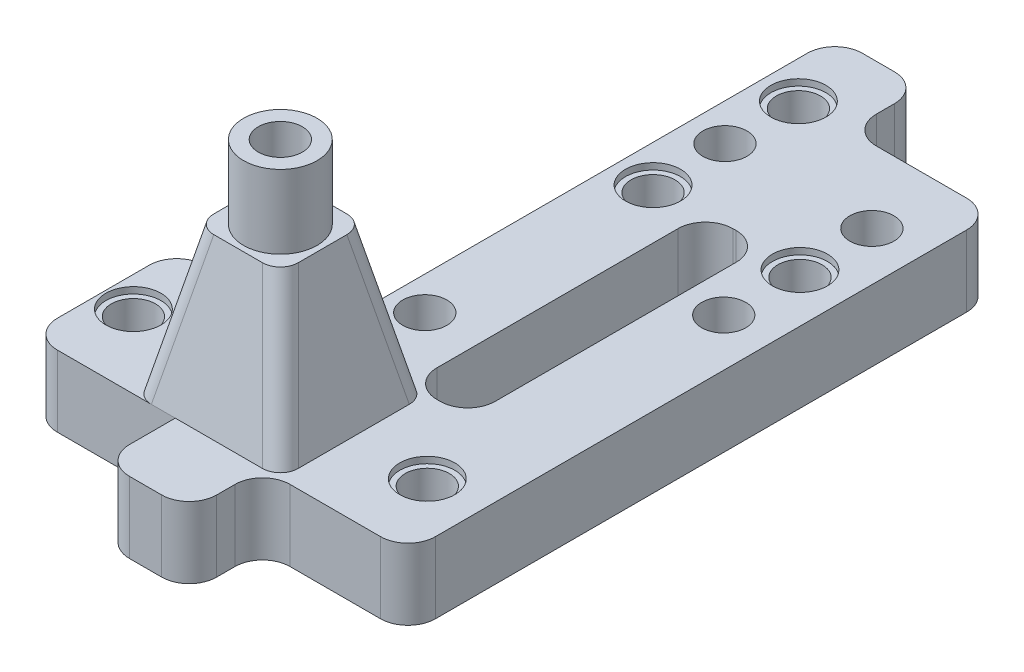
ISO-10303-21;
HEADER;
FILE_DESCRIPTION(('STEP AP214'),'2;1');
FILE_NAME('part.step','',(''),(''),'','','');
FILE_SCHEMA(('AUTOMOTIVE_DESIGN { 1 0 10303 214 1 1 1 1 }'));
ENDSEC;
DATA;
#1=APPLICATION_CONTEXT('core data for automotive mechanical design processes');
#2=APPLICATION_PROTOCOL_DEFINITION('international standard','automotive_design',2000,#1);
#3=PRODUCT_CONTEXT('',#1,'mechanical');
#4=PRODUCT('Part','Part','',(#3));
#5=PRODUCT_RELATED_PRODUCT_CATEGORY('part','',(#4));
#6=PRODUCT_DEFINITION_FORMATION('','',#4);
#7=PRODUCT_DEFINITION_CONTEXT('part definition',#1,'design');
#8=PRODUCT_DEFINITION('design','',#6,#7);
#9=PRODUCT_DEFINITION_SHAPE('','',#8);
#10=(LENGTH_UNIT() NAMED_UNIT(*) SI_UNIT(.MILLI.,.METRE.));
#11=(NAMED_UNIT(*) PLANE_ANGLE_UNIT() SI_UNIT($,.RADIAN.));
#12=(NAMED_UNIT(*) SI_UNIT($,.STERADIAN.) SOLID_ANGLE_UNIT());
#13=UNCERTAINTY_MEASURE_WITH_UNIT(LENGTH_MEASURE(1.E-05),#10,'distance_accuracy_value','');
#14=(GEOMETRIC_REPRESENTATION_CONTEXT(3) GLOBAL_UNCERTAINTY_ASSIGNED_CONTEXT((#13)) GLOBAL_UNIT_ASSIGNED_CONTEXT((#10,
#11,#12)) REPRESENTATION_CONTEXT('',''));
#15=CARTESIAN_POINT('',(0.,0.,0.));
#16=DIRECTION('',(0.,0.,1.));
#17=DIRECTION('',(1.,0.,0.));
#18=AXIS2_PLACEMENT_3D('',#15,#16,#17);
#19=CARTESIAN_POINT('',(11.282,23.75,-16.));
#20=DIRECTION('',(0.,1.,0.));
#21=DIRECTION('',(0.,0.,1.));
#22=AXIS2_PLACEMENT_3D('',#19,#20,#21);
#23=PLANE('',#22);
#24=DIRECTION('',(0.,0.,1.));
#25=VECTOR('',#24,1.);
#26=CARTESIAN_POINT('',(23.8810950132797,23.75,0.));
#27=LINE('',#26,#25);
#28=CARTESIAN_POINT('',(23.8810950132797,23.75,-5.35720018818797));
#29=VERTEX_POINT('',#28);
#30=CARTESIAN_POINT('',(23.8810950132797,23.75,-10.642799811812));
#31=VERTEX_POINT('',#30);
#32=EDGE_CURVE('E595',#29,#31,#27,.F.);
#33=ORIENTED_EDGE('',*,*,#32,.T.);
#34=CARTESIAN_POINT('',(21.8364138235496,23.75,-10.5544138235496));
#35=DIRECTION('',(0.,1.,0.));
#36=DIRECTION('',(0.707106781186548,0.,-0.707106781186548));
#37=AXIS2_PLACEMENT_3D('',#34,#35,#36);
#38=ELLIPSE('',#37,2.08840664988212,2.);
#39=CARTESIAN_POINT('',(21.924799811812,23.75,-12.5990950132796));
#40=VERTEX_POINT('',#39);
#41=EDGE_CURVE('E555',#31,#40,#38,.T.);
#42=ORIENTED_EDGE('',*,*,#41,.T.);
#43=DIRECTION('',(1.,0.,0.));
#44=VECTOR('',#43,1.);
#45=CARTESIAN_POINT('',(27.282,23.75,-12.5990950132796));
#46=LINE('',#45,#44);
#47=CARTESIAN_POINT('',(16.639200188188,23.75,-12.5990950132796));
#48=VERTEX_POINT('',#47);
#49=EDGE_CURVE('E601',#40,#48,#46,.F.);
#50=ORIENTED_EDGE('',*,*,#49,.T.);
#51=CARTESIAN_POINT('',(16.7275861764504,23.75,-10.5544138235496));
#52=DIRECTION('',(0.,1.,0.));
#53=DIRECTION('',(-0.707106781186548,0.,-0.707106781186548));
#54=AXIS2_PLACEMENT_3D('',#51,#52,#53);
#55=ELLIPSE('',#54,2.08840664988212,2.);
#56=CARTESIAN_POINT('',(14.6829049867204,23.75,-10.642799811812));
#57=VERTEX_POINT('',#56);
#58=EDGE_CURVE('E549',#48,#57,#55,.T.);
#59=ORIENTED_EDGE('',*,*,#58,.T.);
#60=DIRECTION('',(0.,0.,-1.));
#61=VECTOR('',#60,1.);
#62=CARTESIAN_POINT('',(14.6829049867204,23.75,0.));
#63=LINE('',#62,#61);
#64=CARTESIAN_POINT('',(14.6829049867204,23.75,-5.35720018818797));
#65=VERTEX_POINT('',#64);
#66=EDGE_CURVE('E606',#57,#65,#63,.F.);
#67=ORIENTED_EDGE('',*,*,#66,.T.);
#68=CARTESIAN_POINT('',(16.7275861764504,23.75,-5.44558617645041));
#69=DIRECTION('',(0.,1.,0.));
#70=DIRECTION('',(-0.707106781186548,0.,0.707106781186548));
#71=AXIS2_PLACEMENT_3D('',#68,#69,#70);
#72=ELLIPSE('',#71,2.08840664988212,2.);
#73=CARTESIAN_POINT('',(16.639200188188,23.75,-3.40090498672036));
#74=VERTEX_POINT('',#73);
#75=EDGE_CURVE('E551',#65,#74,#72,.T.);
#76=ORIENTED_EDGE('',*,*,#75,.T.);
#77=DIRECTION('',(-1.,0.,0.));
#78=VECTOR('',#77,1.);
#79=CARTESIAN_POINT('',(27.282,23.75,-3.40090498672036));
#80=LINE('',#79,#78);
#81=CARTESIAN_POINT('',(21.924799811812,23.75,-3.40090498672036));
#82=VERTEX_POINT('',#81);
#83=EDGE_CURVE('E597',#74,#82,#80,.F.);
#84=ORIENTED_EDGE('',*,*,#83,.T.);
#85=CARTESIAN_POINT('',(21.8364138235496,23.75,-5.44558617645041));
#86=DIRECTION('',(0.,1.,0.));
#87=DIRECTION('',(0.707106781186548,0.,0.707106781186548));
#88=AXIS2_PLACEMENT_3D('',#85,#86,#87);
#89=ELLIPSE('',#88,2.08840664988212,2.);
#90=EDGE_CURVE('E553',#82,#29,#89,.T.);
#91=ORIENTED_EDGE('',*,*,#90,.T.);
#92=EDGE_LOOP('',(#33,#42,#50,#59,#67,#76,#84,#91));
#93=FACE_BOUND('',#92,.T.);
#94=CARTESIAN_POINT('',(19.282,23.75,-8.));
#95=DIRECTION('',(0.,1.,0.));
#96=DIRECTION('',(0.,0.,1.));
#97=AXIS2_PLACEMENT_3D('',#94,#95,#96);
#98=CIRCLE('',#97,4.);
#99=CARTESIAN_POINT('',(19.282,23.75,-4.));
#100=VERTEX_POINT('',#99);
#101=EDGE_CURVE('E786',#100,#100,#98,.T.);
#102=ORIENTED_EDGE('',*,*,#101,.F.);
#103=EDGE_LOOP('',(#102));
#104=FACE_BOUND('',#103,.T.);
#105=ADVANCED_FACE('F39',(#93,#104),#23,.T.);
#106=CARTESIAN_POINT('',(0.,7.75,0.));
#107=DIRECTION('',(0.,1.,0.));
#108=DIRECTION('',(0.,0.,1.));
#109=AXIS2_PLACEMENT_3D('',#106,#107,#108);
#110=PLANE('',#109);
#111=CARTESIAN_POINT('',(3.28200000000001,7.75,-8.));
#112=DIRECTION('',(0.,1.,0.));
#113=DIRECTION('',(0.,0.,1.));
#114=AXIS2_PLACEMENT_3D('',#111,#112,#113);
#115=CIRCLE('',#114,3.);
#116=CARTESIAN_POINT('',(3.28200000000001,7.75,-5.));
#117=VERTEX_POINT('',#116);
#118=EDGE_CURVE('E366',#117,#117,#115,.T.);
#119=ORIENTED_EDGE('',*,*,#118,.F.);
#120=EDGE_LOOP('',(#119));
#121=FACE_BOUND('',#120,.T.);
#122=DIRECTION('',(1.,0.,0.));
#123=VECTOR('',#122,1.);
#124=CARTESIAN_POINT('',(0.,7.75,0.));
#125=LINE('',#124,#123);
#126=CARTESIAN_POINT('',(3.,7.75,0.));
#127=VERTEX_POINT('',#126);
#128=CARTESIAN_POINT('',(13.2382952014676,7.75,0.));
#129=VERTEX_POINT('',#128);
#130=EDGE_CURVE('E707',#127,#129,#125,.T.);
#131=ORIENTED_EDGE('',*,*,#130,.T.);
#132=CARTESIAN_POINT('',(13.3266811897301,7.75,-2.04468118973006));
#133=DIRECTION('',(0.,1.,0.));
#134=DIRECTION('',(-0.707106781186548,0.,0.707106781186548));
#135=AXIS2_PLACEMENT_3D('',#132,#133,#134);
#136=ELLIPSE('',#135,2.08840664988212,2.);
#137=CARTESIAN_POINT('',(11.282,7.75,-1.95629520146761));
#138=VERTEX_POINT('',#137);
#139=EDGE_CURVE('E48',#129,#138,#136,.F.);
#140=ORIENTED_EDGE('',*,*,#139,.T.);
#141=DIRECTION('',(0.,0.,1.));
#142=VECTOR('',#141,1.);
#143=CARTESIAN_POINT('',(11.282,7.75,0.));
#144=LINE('',#143,#142);
#145=CARTESIAN_POINT('',(11.282,7.75,-14.0437047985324));
#146=VERTEX_POINT('',#145);
#147=EDGE_CURVE('E587',#146,#138,#144,.T.);
#148=ORIENTED_EDGE('',*,*,#147,.F.);
#149=CARTESIAN_POINT('',(13.3266811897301,7.75,-13.9553188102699));
#150=DIRECTION('',(0.,1.,0.));
#151=DIRECTION('',(-0.707106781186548,0.,-0.707106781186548));
#152=AXIS2_PLACEMENT_3D('',#149,#150,#151);
#153=ELLIPSE('',#152,2.08840664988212,2.);
#154=CARTESIAN_POINT('',(13.2382952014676,7.75,-16.));
#155=VERTEX_POINT('',#154);
#156=EDGE_CURVE('E11',#146,#155,#153,.F.);
#157=ORIENTED_EDGE('',*,*,#156,.T.);
#158=DIRECTION('',(-1.,0.,0.));
#159=VECTOR('',#158,1.);
#160=CARTESIAN_POINT('',(27.282,7.75,-16.));
#161=LINE('',#160,#159);
#162=CARTESIAN_POINT('',(25.3257047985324,7.75,-16.));
#163=VERTEX_POINT('',#162);
#164=EDGE_CURVE('E767',#163,#155,#161,.T.);
#165=ORIENTED_EDGE('',*,*,#164,.F.);
#166=CARTESIAN_POINT('',(25.23731881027,7.75,-13.9553188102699));
#167=DIRECTION('',(0.,1.,0.));
#168=DIRECTION('',(0.707106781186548,0.,-0.707106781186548));
#169=AXIS2_PLACEMENT_3D('',#166,#167,#168);
#170=ELLIPSE('',#169,2.08840664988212,2.);
#171=CARTESIAN_POINT('',(27.282,7.75,-14.0437047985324));
#172=VERTEX_POINT('',#171);
#173=EDGE_CURVE('E567',#163,#172,#170,.F.);
#174=ORIENTED_EDGE('',*,*,#173,.T.);
#175=DIRECTION('',(0.,0.,-1.));
#176=VECTOR('',#175,1.);
#177=CARTESIAN_POINT('',(27.282,7.75,0.));
#178=LINE('',#177,#176);
#179=CARTESIAN_POINT('',(27.282,7.75,-1.95629520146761));
#180=VERTEX_POINT('',#179);
#181=EDGE_CURVE('E577',#180,#172,#178,.T.);
#182=ORIENTED_EDGE('',*,*,#181,.F.);
#183=CARTESIAN_POINT('',(25.23731881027,7.75,-2.04468118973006));
#184=DIRECTION('',(0.,1.,0.));
#185=DIRECTION('',(0.707106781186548,0.,0.707106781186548));
#186=AXIS2_PLACEMENT_3D('',#183,#184,#185);
#187=ELLIPSE('',#186,2.08840664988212,2.);
#188=CARTESIAN_POINT('',(25.3257047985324,7.75,0.));
#189=VERTEX_POINT('',#188);
#190=EDGE_CURVE('E569',#180,#189,#187,.F.);
#191=ORIENTED_EDGE('',*,*,#190,.T.);
#192=DIRECTION('',(1.,0.,0.));
#193=VECTOR('',#192,1.);
#194=CARTESIAN_POINT('',(27.282,7.75,0.));
#195=LINE('',#194,#193);
#196=CARTESIAN_POINT('',(15.841,7.75,0.));
#197=VERTEX_POINT('',#196);
#198=EDGE_CURVE('E574',#197,#189,#195,.T.);
#199=ORIENTED_EDGE('',*,*,#198,.F.);
#200=DIRECTION('',(0.,0.,1.));
#201=VECTOR('',#200,1.);
#202=CARTESIAN_POINT('',(15.841,7.75,0.));
#203=LINE('',#202,#201);
#204=CARTESIAN_POINT('',(15.841,7.75,4.985));
#205=VERTEX_POINT('',#204);
#206=EDGE_CURVE('E709',#197,#205,#203,.T.);
#207=ORIENTED_EDGE('',*,*,#206,.T.);
#208=CARTESIAN_POINT('',(18.841,7.75,4.985));
#209=DIRECTION('',(0.,1.,0.));
#210=DIRECTION('',(0.,0.,1.));
#211=AXIS2_PLACEMENT_3D('',#208,#209,#210);
#212=CIRCLE('',#211,3.);
#213=CARTESIAN_POINT('',(18.841,7.75,7.985));
#214=VERTEX_POINT('',#213);
#215=EDGE_CURVE('E411',#205,#214,#212,.T.);
#216=ORIENTED_EDGE('',*,*,#215,.T.);
#217=DIRECTION('',(1.,0.,0.));
#218=VECTOR('',#217,1.);
#219=CARTESIAN_POINT('',(15.841,7.75,7.985));
#220=LINE('',#219,#218);
#221=CARTESIAN_POINT('',(22.341,7.75,7.985));
#222=VERTEX_POINT('',#221);
#223=EDGE_CURVE('E711',#214,#222,#220,.T.);
#224=ORIENTED_EDGE('',*,*,#223,.T.);
#225=CARTESIAN_POINT('',(22.341,7.75,4.985));
#226=DIRECTION('',(0.,1.,0.));
#227=DIRECTION('',(0.,0.,1.));
#228=AXIS2_PLACEMENT_3D('',#225,#226,#227);
#229=CIRCLE('',#228,3.);
#230=CARTESIAN_POINT('',(25.341,7.75,4.985));
#231=VERTEX_POINT('',#230);
#232=EDGE_CURVE('E413',#222,#231,#229,.T.);
#233=ORIENTED_EDGE('',*,*,#232,.T.);
#234=DIRECTION('',(0.,0.,-1.));
#235=VECTOR('',#234,1.);
#236=CARTESIAN_POINT('',(25.341,7.75,7.985));
#237=LINE('',#236,#235);
#238=CARTESIAN_POINT('',(25.341,7.75,3.));
#239=VERTEX_POINT('',#238);
#240=EDGE_CURVE('E714',#231,#239,#237,.T.);
#241=ORIENTED_EDGE('',*,*,#240,.T.);
#242=CARTESIAN_POINT('',(28.341,7.75,3.));
#243=DIRECTION('',(0.,1.,0.));
#244=DIRECTION('',(0.,0.,1.));
#245=AXIS2_PLACEMENT_3D('',#242,#243,#244);
#246=CIRCLE('',#245,3.);
#247=CARTESIAN_POINT('',(28.341,7.75,0.));
#248=VERTEX_POINT('',#247);
#249=EDGE_CURVE('E500',#239,#248,#246,.F.);
#250=ORIENTED_EDGE('',*,*,#249,.T.);
#251=DIRECTION('',(1.,0.,0.));
#252=VECTOR('',#251,1.);
#253=CARTESIAN_POINT('',(25.341,7.75,0.));
#254=LINE('',#253,#252);
#255=CARTESIAN_POINT('',(38.182,7.75,0.));
#256=VERTEX_POINT('',#255);
#257=EDGE_CURVE('E717',#248,#256,#254,.T.);
#258=ORIENTED_EDGE('',*,*,#257,.T.);
#259=CARTESIAN_POINT('',(38.182,7.75,-3.));
#260=DIRECTION('',(0.,1.,0.));
#261=DIRECTION('',(0.,0.,1.));
#262=AXIS2_PLACEMENT_3D('',#259,#260,#261);
#263=CIRCLE('',#262,3.);
#264=CARTESIAN_POINT('',(41.182,7.75,-3.));
#265=VERTEX_POINT('',#264);
#266=EDGE_CURVE('E417',#256,#265,#263,.T.);
#267=ORIENTED_EDGE('',*,*,#266,.T.);
#268=DIRECTION('',(0.,0.,-1.));
#269=VECTOR('',#268,1.);
#270=CARTESIAN_POINT('',(41.182,7.75,0.));
#271=LINE('',#270,#269);
#272=CARTESIAN_POINT('',(41.182,7.75,-60.83));
#273=VERTEX_POINT('',#272);
#274=EDGE_CURVE('E720',#265,#273,#271,.T.);
#275=ORIENTED_EDGE('',*,*,#274,.T.);
#276=CARTESIAN_POINT('',(38.182,7.75,-60.83));
#277=DIRECTION('',(0.,1.,0.));
#278=DIRECTION('',(0.,0.,1.));
#279=AXIS2_PLACEMENT_3D('',#276,#277,#278);
#280=CIRCLE('',#279,3.);
#281=CARTESIAN_POINT('',(38.182,7.75,-63.83));
#282=VERTEX_POINT('',#281);
#283=EDGE_CURVE('E415',#273,#282,#280,.T.);
#284=ORIENTED_EDGE('',*,*,#283,.T.);
#285=DIRECTION('',(-1.,0.,0.));
#286=VECTOR('',#285,1.);
#287=CARTESIAN_POINT('',(41.182,7.75,-63.83));
#288=LINE('',#287,#286);
#289=CARTESIAN_POINT('',(28.341,7.75,-63.83));
#290=VERTEX_POINT('',#289);
#291=EDGE_CURVE('E723',#282,#290,#288,.T.);
#292=ORIENTED_EDGE('',*,*,#291,.T.);
#293=CARTESIAN_POINT('',(28.341,7.75,-66.83));
#294=DIRECTION('',(0.,1.,0.));
#295=DIRECTION('',(0.,0.,1.));
#296=AXIS2_PLACEMENT_3D('',#293,#294,#295);
#297=CIRCLE('',#296,3.);
#298=CARTESIAN_POINT('',(25.341,7.75,-66.83));
#299=VERTEX_POINT('',#298);
#300=EDGE_CURVE('E484',#290,#299,#297,.F.);
#301=ORIENTED_EDGE('',*,*,#300,.T.);
#302=DIRECTION('',(0.,0.,-1.));
#303=VECTOR('',#302,1.);
#304=CARTESIAN_POINT('',(25.341,7.75,-63.83));
#305=LINE('',#304,#303);
#306=CARTESIAN_POINT('',(25.341,7.75,-68.815));
#307=VERTEX_POINT('',#306);
#308=EDGE_CURVE('E726',#299,#307,#305,.T.);
#309=ORIENTED_EDGE('',*,*,#308,.T.);
#310=CARTESIAN_POINT('',(22.341,7.75,-68.815));
#311=DIRECTION('',(0.,1.,0.));
#312=DIRECTION('',(0.,0.,1.));
#313=AXIS2_PLACEMENT_3D('',#310,#311,#312);
#314=CIRCLE('',#313,3.);
#315=CARTESIAN_POINT('',(22.341,7.75,-71.815));
#316=VERTEX_POINT('',#315);
#317=EDGE_CURVE('E405',#307,#316,#314,.T.);
#318=ORIENTED_EDGE('',*,*,#317,.T.);
#319=DIRECTION('',(-1.,0.,0.));
#320=VECTOR('',#319,1.);
#321=CARTESIAN_POINT('',(25.341,7.75,-71.815));
#322=LINE('',#321,#320);
#323=CARTESIAN_POINT('',(18.841,7.75,-71.815));
#324=VERTEX_POINT('',#323);
#325=EDGE_CURVE('E306',#316,#324,#322,.T.);
#326=ORIENTED_EDGE('',*,*,#325,.T.);
#327=CARTESIAN_POINT('',(18.841,7.75,-68.815));
#328=DIRECTION('',(0.,1.,0.));
#329=DIRECTION('',(0.,0.,1.));
#330=AXIS2_PLACEMENT_3D('',#327,#328,#329);
#331=CIRCLE('',#330,3.);
#332=CARTESIAN_POINT('',(15.841,7.75,-68.815));
#333=VERTEX_POINT('',#332);
#334=EDGE_CURVE('E403',#324,#333,#331,.T.);
#335=ORIENTED_EDGE('',*,*,#334,.T.);
#336=DIRECTION('',(0.,0.,1.));
#337=VECTOR('',#336,1.);
#338=CARTESIAN_POINT('',(15.841,7.75,-71.815));
#339=LINE('',#338,#337);
#340=CARTESIAN_POINT('',(15.841,7.75,-19.));
#341=VERTEX_POINT('',#340);
#342=EDGE_CURVE('E305',#333,#341,#339,.T.);
#343=ORIENTED_EDGE('',*,*,#342,.T.);
#344=CARTESIAN_POINT('',(12.841,7.75,-19.));
#345=DIRECTION('',(0.,1.,0.));
#346=DIRECTION('',(0.,0.,1.));
#347=AXIS2_PLACEMENT_3D('',#344,#345,#346);
#348=CIRCLE('',#347,3.);
#349=CARTESIAN_POINT('',(12.841,7.75,-16.));
#350=VERTEX_POINT('',#349);
#351=EDGE_CURVE('E294',#341,#350,#348,.F.);
#352=ORIENTED_EDGE('',*,*,#351,.T.);
#353=DIRECTION('',(-1.,0.,0.));
#354=VECTOR('',#353,1.);
#355=CARTESIAN_POINT('',(15.841,7.75,-16.));
#356=LINE('',#355,#354);
#357=CARTESIAN_POINT('',(11.282,7.75,-16.));
#358=VERTEX_POINT('',#357);
#359=EDGE_CURVE('E286',#350,#358,#356,.T.);
#360=ORIENTED_EDGE('',*,*,#359,.T.);
#361=CARTESIAN_POINT('',(3.,7.75,-16.));
#362=VERTEX_POINT('',#361);
#363=EDGE_CURVE('E290',#358,#362,#356,.T.);
#364=ORIENTED_EDGE('',*,*,#363,.T.);
#365=CARTESIAN_POINT('',(3.,7.75,-13.));
#366=DIRECTION('',(0.,1.,0.));
#367=DIRECTION('',(0.,0.,1.));
#368=AXIS2_PLACEMENT_3D('',#365,#366,#367);
#369=CIRCLE('',#368,3.);
#370=CARTESIAN_POINT('',(0.,7.75,-13.));
#371=VERTEX_POINT('',#370);
#372=EDGE_CURVE('E407',#362,#371,#369,.T.);
#373=ORIENTED_EDGE('',*,*,#372,.T.);
#374=DIRECTION('',(0.,0.,1.));
#375=VECTOR('',#374,1.);
#376=CARTESIAN_POINT('',(0.,7.75,-16.));
#377=LINE('',#376,#375);
#378=CARTESIAN_POINT('',(0.,7.75,-3.));
#379=VERTEX_POINT('',#378);
#380=EDGE_CURVE('E345',#371,#379,#377,.T.);
#381=ORIENTED_EDGE('',*,*,#380,.T.);
#382=CARTESIAN_POINT('',(3.,7.75,-3.));
#383=DIRECTION('',(0.,1.,0.));
#384=DIRECTION('',(0.,0.,1.));
#385=AXIS2_PLACEMENT_3D('',#382,#383,#384);
#386=CIRCLE('',#385,3.);
#387=EDGE_CURVE('E409',#379,#127,#386,.T.);
#388=ORIENTED_EDGE('',*,*,#387,.T.);
#389=EDGE_LOOP('',(#131,#140,#148,#157,#165,#174,#182,#191,#199,#207,#216,#224,#233,#241,#250,
#258,#267,#275,#284,#292,#301,#309,#318,#326,#335,#343,#352,#360,#364,#373,#381,#388));
#390=FACE_BOUND('',#389,.T.);
#391=DIRECTION('',(0.,0.,1.));
#392=VECTOR('',#391,1.);
#393=CARTESIAN_POINT('',(25.341,7.75,-48.23));
#394=LINE('',#393,#392);
#395=CARTESIAN_POINT('',(25.341,7.75,-45.23));
#396=VERTEX_POINT('',#395);
#397=CARTESIAN_POINT('',(25.341,7.75,-19.));
#398=VERTEX_POINT('',#397);
#399=EDGE_CURVE('E680',#396,#398,#394,.T.);
#400=ORIENTED_EDGE('',*,*,#399,.F.);
#401=CARTESIAN_POINT('',(28.341,7.75,-45.23));
#402=DIRECTION('',(0.,1.,0.));
#403=DIRECTION('',(0.,0.,1.));
#404=AXIS2_PLACEMENT_3D('',#401,#402,#403);
#405=CIRCLE('',#404,3.);
#406=CARTESIAN_POINT('',(28.341,7.75,-48.23));
#407=VERTEX_POINT('',#406);
#408=EDGE_CURVE('E490',#396,#407,#405,.F.);
#409=ORIENTED_EDGE('',*,*,#408,.T.);
#410=DIRECTION('',(-1.,0.,0.));
#411=VECTOR('',#410,1.);
#412=CARTESIAN_POINT('',(25.341,7.75,-48.23));
#413=LINE('',#412,#411);
#414=CARTESIAN_POINT('',(28.681,7.75,-48.23));
#415=VERTEX_POINT('',#414);
#416=EDGE_CURVE('E687',#415,#407,#413,.T.);
#417=ORIENTED_EDGE('',*,*,#416,.F.);
#418=CARTESIAN_POINT('',(28.681,7.75,-45.23));
#419=DIRECTION('',(0.,1.,0.));
#420=DIRECTION('',(0.,0.,1.));
#421=AXIS2_PLACEMENT_3D('',#418,#419,#420);
#422=CIRCLE('',#421,3.);
#423=CARTESIAN_POINT('',(31.681,7.75,-45.23));
#424=VERTEX_POINT('',#423);
#425=EDGE_CURVE('E486',#415,#424,#422,.F.);
#426=ORIENTED_EDGE('',*,*,#425,.T.);
#427=DIRECTION('',(0.,0.,-1.));
#428=VECTOR('',#427,1.);
#429=CARTESIAN_POINT('',(31.681,7.75,-48.23));
#430=LINE('',#429,#428);
#431=CARTESIAN_POINT('',(31.681,7.75,-19.));
#432=VERTEX_POINT('',#431);
#433=EDGE_CURVE('E700',#432,#424,#430,.T.);
#434=ORIENTED_EDGE('',*,*,#433,.F.);
#435=CARTESIAN_POINT('',(28.681,7.75,-19.));
#436=DIRECTION('',(0.,1.,0.));
#437=DIRECTION('',(0.,0.,1.));
#438=AXIS2_PLACEMENT_3D('',#435,#436,#437);
#439=CIRCLE('',#438,3.);
#440=CARTESIAN_POINT('',(28.681,7.75,-16.));
#441=VERTEX_POINT('',#440);
#442=EDGE_CURVE('E505',#432,#441,#439,.F.);
#443=ORIENTED_EDGE('',*,*,#442,.T.);
#444=DIRECTION('',(1.,0.,0.));
#445=VECTOR('',#444,1.);
#446=CARTESIAN_POINT('',(31.681,7.75,-16.));
#447=LINE('',#446,#445);
#448=CARTESIAN_POINT('',(28.341,7.75,-16.));
#449=VERTEX_POINT('',#448);
#450=EDGE_CURVE('E697',#449,#441,#447,.T.);
#451=ORIENTED_EDGE('',*,*,#450,.F.);
#452=CARTESIAN_POINT('',(28.341,7.75,-19.));
#453=DIRECTION('',(0.,1.,0.));
#454=DIRECTION('',(0.,0.,1.));
#455=AXIS2_PLACEMENT_3D('',#452,#453,#454);
#456=CIRCLE('',#455,3.);
#457=EDGE_CURVE('E494',#449,#398,#456,.F.);
#458=ORIENTED_EDGE('',*,*,#457,.T.);
#459=EDGE_LOOP('',(#400,#409,#417,#426,#434,#443,#451,#458));
#460=FACE_BOUND('',#459,.T.);
#461=CARTESIAN_POINT('',(19.882,7.75,-55.81));
#462=DIRECTION('',(0.,1.,0.));
#463=DIRECTION('',(0.,0.,1.));
#464=AXIS2_PLACEMENT_3D('',#461,#462,#463);
#465=CIRCLE('',#464,2.4);
#466=CARTESIAN_POINT('',(19.882,7.75,-53.41));
#467=VERTEX_POINT('',#466);
#468=EDGE_CURVE('E674',#467,#467,#465,.T.);
#469=ORIENTED_EDGE('',*,*,#468,.F.);
#470=EDGE_LOOP('',(#469));
#471=FACE_BOUND('',#470,.T.);
#472=CARTESIAN_POINT('',(35.882,7.75,-55.81));
#473=DIRECTION('',(0.,1.,0.));
#474=DIRECTION('',(0.,0.,1.));
#475=AXIS2_PLACEMENT_3D('',#472,#473,#474);
#476=CIRCLE('',#475,2.4);
#477=CARTESIAN_POINT('',(35.882,7.75,-53.41));
#478=VERTEX_POINT('',#477);
#479=EDGE_CURVE('E352',#478,#478,#476,.T.);
#480=ORIENTED_EDGE('',*,*,#479,.F.);
#481=EDGE_LOOP('',(#480));
#482=FACE_BOUND('',#481,.T.);
#483=CARTESIAN_POINT('',(35.282,7.75,-8.));
#484=DIRECTION('',(0.,1.,0.));
#485=DIRECTION('',(0.,0.,1.));
#486=AXIS2_PLACEMENT_3D('',#483,#484,#485);
#487=CIRCLE('',#486,3.);
#488=CARTESIAN_POINT('',(35.282,7.75,-5.));
#489=VERTEX_POINT('',#488);
#490=EDGE_CURVE('E357',#489,#489,#487,.T.);
#491=ORIENTED_EDGE('',*,*,#490,.F.);
#492=EDGE_LOOP('',(#491));
#493=FACE_BOUND('',#492,.T.);
#494=CARTESIAN_POINT('',(19.482,7.75,-23.53));
#495=DIRECTION('',(0.,1.,0.));
#496=DIRECTION('',(0.,0.,1.));
#497=AXIS2_PLACEMENT_3D('',#494,#495,#496);
#498=CIRCLE('',#497,2.4);
#499=CARTESIAN_POINT('',(19.482,7.75,-21.13));
#500=VERTEX_POINT('',#499);
#501=EDGE_CURVE('E640',#500,#500,#498,.T.);
#502=ORIENTED_EDGE('',*,*,#501,.F.);
#503=EDGE_LOOP('',(#502));
#504=FACE_BOUND('',#503,.T.);
#505=CARTESIAN_POINT('',(35.982,7.75,-39.58));
#506=DIRECTION('',(0.,1.,0.));
#507=DIRECTION('',(0.,0.,1.));
#508=AXIS2_PLACEMENT_3D('',#505,#506,#507);
#509=CIRCLE('',#508,2.4);
#510=CARTESIAN_POINT('',(35.982,7.75,-37.18));
#511=VERTEX_POINT('',#510);
#512=EDGE_CURVE('E513',#511,#511,#509,.T.);
#513=ORIENTED_EDGE('',*,*,#512,.F.);
#514=EDGE_LOOP('',(#513));
#515=FACE_BOUND('',#514,.T.);
#516=CARTESIAN_POINT('',(19.882,7.75,-63.81));
#517=DIRECTION('',(0.,1.,0.));
#518=DIRECTION('',(0.,0.,1.));
#519=AXIS2_PLACEMENT_3D('',#516,#517,#518);
#520=CIRCLE('',#519,3.);
#521=CARTESIAN_POINT('',(19.882,7.75,-60.81));
#522=VERTEX_POINT('',#521);
#523=EDGE_CURVE('E518',#522,#522,#520,.T.);
#524=ORIENTED_EDGE('',*,*,#523,.F.);
#525=EDGE_LOOP('',(#524));
#526=FACE_BOUND('',#525,.T.);
#527=CARTESIAN_POINT('',(19.882,7.75,-47.98));
#528=DIRECTION('',(0.,1.,0.));
#529=DIRECTION('',(0.,0.,1.));
#530=AXIS2_PLACEMENT_3D('',#527,#528,#529);
#531=CIRCLE('',#530,3.);
#532=CARTESIAN_POINT('',(19.882,7.75,-44.98));
#533=VERTEX_POINT('',#532);
#534=EDGE_CURVE('E523',#533,#533,#531,.T.);
#535=ORIENTED_EDGE('',*,*,#534,.F.);
#536=EDGE_LOOP('',(#535));
#537=FACE_BOUND('',#536,.T.);
#538=CARTESIAN_POINT('',(35.882,7.75,-47.98));
#539=DIRECTION('',(0.,1.,0.));
#540=DIRECTION('',(0.,0.,1.));
#541=AXIS2_PLACEMENT_3D('',#538,#539,#540);
#542=CIRCLE('',#541,3.);
#543=CARTESIAN_POINT('',(35.882,7.75,-44.98));
#544=VERTEX_POINT('',#543);
#545=EDGE_CURVE('E528',#544,#544,#542,.T.);
#546=ORIENTED_EDGE('',*,*,#545,.F.);
#547=EDGE_LOOP('',(#546));
#548=FACE_BOUND('',#547,.T.);
#549=ADVANCED_FACE('F288',(#121,#390,#460,#471,#482,#493,#504,#515,#526,#537,#548),#110,.T.);
#550=CARTESIAN_POINT('',(35.882,0.,-47.98));
#551=DIRECTION('',(0.,1.,0.));
#552=DIRECTION('',(0.,0.,1.));
#553=AXIS2_PLACEMENT_3D('',#550,#551,#552);
#554=CYLINDRICAL_SURFACE('',#553,2.4);
#555=CARTESIAN_POINT('',(35.882,7.05,-47.98));
#556=DIRECTION('',(0.,1.,0.));
#557=DIRECTION('',(0.,0.,1.));
#558=AXIS2_PLACEMENT_3D('',#555,#556,#557);
#559=CIRCLE('',#558,2.4);
#560=CARTESIAN_POINT('',(35.882,7.05,-45.58));
#561=VERTEX_POINT('',#560);
#562=EDGE_CURVE('E520',#561,#561,#559,.F.);
#563=ORIENTED_EDGE('',*,*,#562,.F.);
#564=EDGE_LOOP('',(#563));
#565=FACE_BOUND('',#564,.T.);
#566=CARTESIAN_POINT('',(35.882,0.7,-47.98));
#567=DIRECTION('',(0.,-1.,0.));
#568=DIRECTION('',(0.,0.,-1.));
#569=AXIS2_PLACEMENT_3D('',#566,#567,#568);
#570=CIRCLE('',#569,2.4);
#571=CARTESIAN_POINT('',(35.882,0.7,-50.38));
#572=VERTEX_POINT('',#571);
#573=EDGE_CURVE('E535',#572,#572,#570,.F.);
#574=ORIENTED_EDGE('',*,*,#573,.F.);
#575=EDGE_LOOP('',(#574));
#576=FACE_BOUND('',#575,.T.);
#577=ADVANCED_FACE('F821',(#565,#576),#554,.F.);
#578=CARTESIAN_POINT('',(19.882,0.,-47.98));
#579=DIRECTION('',(0.,1.,0.));
#580=DIRECTION('',(0.,0.,1.));
#581=AXIS2_PLACEMENT_3D('',#578,#579,#580);
#582=CYLINDRICAL_SURFACE('',#581,2.4);
#583=CARTESIAN_POINT('',(19.882,7.05,-47.98));
#584=DIRECTION('',(0.,1.,0.));
#585=DIRECTION('',(0.,0.,1.));
#586=AXIS2_PLACEMENT_3D('',#583,#584,#585);
#587=CIRCLE('',#586,2.4);
#588=CARTESIAN_POINT('',(19.882,7.05,-45.58));
#589=VERTEX_POINT('',#588);
#590=EDGE_CURVE('E515',#589,#589,#587,.F.);
#591=ORIENTED_EDGE('',*,*,#590,.F.);
#592=EDGE_LOOP('',(#591));
#593=FACE_BOUND('',#592,.T.);
#594=CARTESIAN_POINT('',(19.882,0.7,-47.98));
#595=DIRECTION('',(0.,-1.,0.));
#596=DIRECTION('',(0.,0.,-1.));
#597=AXIS2_PLACEMENT_3D('',#594,#595,#596);
#598=CIRCLE('',#597,2.4);
#599=CARTESIAN_POINT('',(19.882,0.7,-50.38));
#600=VERTEX_POINT('',#599);
#601=EDGE_CURVE('E530',#600,#600,#598,.F.);
#602=ORIENTED_EDGE('',*,*,#601,.F.);
#603=EDGE_LOOP('',(#602));
#604=FACE_BOUND('',#603,.T.);
#605=ADVANCED_FACE('F889',(#593,#604),#582,.F.);
#606=CARTESIAN_POINT('',(19.882,0.,-63.81));
#607=DIRECTION('',(0.,1.,0.));
#608=DIRECTION('',(0.,0.,1.));
#609=AXIS2_PLACEMENT_3D('',#606,#607,#608);
#610=CYLINDRICAL_SURFACE('',#609,2.4);
#611=CARTESIAN_POINT('',(19.882,7.05,-63.81));
#612=DIRECTION('',(0.,1.,0.));
#613=DIRECTION('',(0.,0.,1.));
#614=AXIS2_PLACEMENT_3D('',#611,#612,#613);
#615=CIRCLE('',#614,2.4);
#616=CARTESIAN_POINT('',(19.882,7.05,-61.41));
#617=VERTEX_POINT('',#616);
#618=EDGE_CURVE('E510',#617,#617,#615,.F.);
#619=ORIENTED_EDGE('',*,*,#618,.F.);
#620=EDGE_LOOP('',(#619));
#621=FACE_BOUND('',#620,.T.);
#622=CARTESIAN_POINT('',(19.882,0.7,-63.81));
#623=DIRECTION('',(0.,-1.,0.));
#624=DIRECTION('',(0.,0.,-1.));
#625=AXIS2_PLACEMENT_3D('',#622,#623,#624);
#626=CIRCLE('',#625,2.4);
#627=CARTESIAN_POINT('',(19.882,0.7,-66.21));
#628=VERTEX_POINT('',#627);
#629=EDGE_CURVE('E525',#628,#628,#626,.F.);
#630=ORIENTED_EDGE('',*,*,#629,.F.);
#631=EDGE_LOOP('',(#630));
#632=FACE_BOUND('',#631,.T.);
#633=ADVANCED_FACE('F891',(#621,#632),#610,.F.);
#634=CARTESIAN_POINT('',(35.282,0.,-8.));
#635=DIRECTION('',(0.,1.,0.));
#636=DIRECTION('',(0.,0.,1.));
#637=AXIS2_PLACEMENT_3D('',#634,#635,#636);
#638=CYLINDRICAL_SURFACE('',#637,2.4);
#639=CARTESIAN_POINT('',(35.282,7.05,-8.));
#640=DIRECTION('',(0.,1.,0.));
#641=DIRECTION('',(0.,0.,1.));
#642=AXIS2_PLACEMENT_3D('',#639,#640,#641);
#643=CIRCLE('',#642,2.4);
#644=CARTESIAN_POINT('',(35.282,7.05,-5.6));
#645=VERTEX_POINT('',#644);
#646=EDGE_CURVE('E349',#645,#645,#643,.F.);
#647=ORIENTED_EDGE('',*,*,#646,.F.);
#648=EDGE_LOOP('',(#647));
#649=FACE_BOUND('',#648,.T.);
#650=CARTESIAN_POINT('',(35.282,0.7,-8.));
#651=DIRECTION('',(0.,-1.,0.));
#652=DIRECTION('',(0.,0.,-1.));
#653=AXIS2_PLACEMENT_3D('',#650,#651,#652);
#654=CIRCLE('',#653,2.4);
#655=CARTESIAN_POINT('',(35.282,0.7,-10.4));
#656=VERTEX_POINT('',#655);
#657=EDGE_CURVE('E373',#656,#656,#654,.F.);
#658=ORIENTED_EDGE('',*,*,#657,.F.);
#659=EDGE_LOOP('',(#658));
#660=FACE_BOUND('',#659,.T.);
#661=ADVANCED_FACE('F894',(#649,#660),#638,.F.);
#662=CARTESIAN_POINT('',(19.282,0.,-8.));
#663=DIRECTION('',(0.,1.,0.));
#664=DIRECTION('',(0.,0.,1.));
#665=AXIS2_PLACEMENT_3D('',#662,#663,#664);
#666=CYLINDRICAL_SURFACE('',#665,2.4);
#667=CARTESIAN_POINT('',(19.282,7.05,-8.));
#668=DIRECTION('',(0.,1.,0.));
#669=DIRECTION('',(0.,0.,1.));
#670=AXIS2_PLACEMENT_3D('',#667,#668,#669);
#671=CIRCLE('',#670,2.4);
#672=CARTESIAN_POINT('',(19.282,7.05,-5.6));
#673=VERTEX_POINT('',#672);
#674=EDGE_CURVE('E354',#673,#673,#671,.F.);
#675=ORIENTED_EDGE('',*,*,#674,.F.);
#676=EDGE_LOOP('',(#675));
#677=FACE_BOUND('',#676,.T.);
#678=CARTESIAN_POINT('',(19.282,0.7,-8.));
#679=DIRECTION('',(0.,-1.,0.));
#680=DIRECTION('',(0.,0.,-1.));
#681=AXIS2_PLACEMENT_3D('',#678,#679,#680);
#682=CIRCLE('',#681,2.4);
#683=CARTESIAN_POINT('',(19.282,0.7,-10.4));
#684=VERTEX_POINT('',#683);
#685=EDGE_CURVE('E368',#684,#684,#682,.F.);
#686=ORIENTED_EDGE('',*,*,#685,.F.);
#687=EDGE_LOOP('',(#686));
#688=FACE_BOUND('',#687,.T.);
#689=ADVANCED_FACE('F963',(#677,#688),#666,.F.);
#690=CARTESIAN_POINT('',(3.28200000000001,0.,-8.));
#691=DIRECTION('',(0.,1.,0.));
#692=DIRECTION('',(0.,0.,1.));
#693=AXIS2_PLACEMENT_3D('',#690,#691,#692);
#694=CYLINDRICAL_SURFACE('',#693,2.4);
#695=CARTESIAN_POINT('',(3.28200000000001,7.05,-8.));
#696=DIRECTION('',(0.,1.,0.));
#697=DIRECTION('',(0.,0.,1.));
#698=AXIS2_PLACEMENT_3D('',#695,#696,#697);
#699=CIRCLE('',#698,2.4);
#700=CARTESIAN_POINT('',(3.28200000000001,7.05,-5.6));
#701=VERTEX_POINT('',#700);
#702=EDGE_CURVE('E359',#701,#701,#699,.F.);
#703=ORIENTED_EDGE('',*,*,#702,.F.);
#704=EDGE_LOOP('',(#703));
#705=FACE_BOUND('',#704,.T.);
#706=CARTESIAN_POINT('',(3.28200000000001,0.7,-8.));
#707=DIRECTION('',(0.,-1.,0.));
#708=DIRECTION('',(0.,0.,-1.));
#709=AXIS2_PLACEMENT_3D('',#706,#707,#708);
#710=CIRCLE('',#709,2.4);
#711=CARTESIAN_POINT('',(3.28200000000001,0.7,-10.4));
#712=VERTEX_POINT('',#711);
#713=EDGE_CURVE('E363',#712,#712,#710,.F.);
#714=ORIENTED_EDGE('',*,*,#713,.F.);
#715=EDGE_LOOP('',(#714));
#716=FACE_BOUND('',#715,.T.);
#717=ADVANCED_FACE('F966',(#705,#716),#694,.F.);
#718=CARTESIAN_POINT('',(0.,7.75,-16.));
#719=DIRECTION('',(1.,0.,0.));
#720=DIRECTION('',(0.,0.,-1.));
#721=AXIS2_PLACEMENT_3D('',#718,#719,#720);
#722=PLANE('',#721);
#723=DIRECTION('',(0.,0.,1.));
#724=VECTOR('',#723,1.);
#725=CARTESIAN_POINT('',(0.,0.,-16.));
#726=LINE('',#725,#724);
#727=CARTESIAN_POINT('',(0.,0.,-13.));
#728=VERTEX_POINT('',#727);
#729=CARTESIAN_POINT('',(0.,0.,-3.));
#730=VERTEX_POINT('',#729);
#731=EDGE_CURVE('E310',#728,#730,#726,.T.);
#732=ORIENTED_EDGE('',*,*,#731,.T.);
#733=DIRECTION('',(0.,-1.,0.));
#734=VECTOR('',#733,1.);
#735=CARTESIAN_POINT('',(0.,7.75,-3.));
#736=LINE('',#735,#734);
#737=EDGE_CURVE('E467',#730,#379,#736,.F.);
#738=ORIENTED_EDGE('',*,*,#737,.T.);
#739=ORIENTED_EDGE('',*,*,#380,.F.);
#740=DIRECTION('',(0.,-1.,0.));
#741=VECTOR('',#740,1.);
#742=CARTESIAN_POINT('',(0.,7.75,-13.));
#743=LINE('',#742,#741);
#744=EDGE_CURVE('E464',#371,#728,#743,.T.);
#745=ORIENTED_EDGE('',*,*,#744,.T.);
#746=EDGE_LOOP('',(#732,#738,#739,#745));
#747=FACE_BOUND('',#746,.T.);
#748=ADVANCED_FACE('F756',(#747),#722,.F.);
#749=CARTESIAN_POINT('',(0.,7.75,0.));
#750=DIRECTION('',(0.,0.,-1.));
#751=DIRECTION('',(-1.,0.,0.));
#752=AXIS2_PLACEMENT_3D('',#749,#750,#751);
#753=PLANE('',#752);
#754=ORIENTED_EDGE('',*,*,#130,.F.);
#755=DIRECTION('',(0.,-1.,0.));
#756=VECTOR('',#755,1.);
#757=CARTESIAN_POINT('',(3.,7.75,0.));
#758=LINE('',#757,#756);
#759=CARTESIAN_POINT('',(3.,0.,0.));
#760=VERTEX_POINT('',#759);
#761=EDGE_CURVE('E461',#127,#760,#758,.T.);
#762=ORIENTED_EDGE('',*,*,#761,.T.);
#763=DIRECTION('',(1.,0.,0.));
#764=VECTOR('',#763,1.);
#765=CARTESIAN_POINT('',(0.,0.,0.));
#766=LINE('',#765,#764);
#767=CARTESIAN_POINT('',(15.841,0.,0.));
#768=VERTEX_POINT('',#767);
#769=EDGE_CURVE('E313',#760,#768,#766,.T.);
#770=ORIENTED_EDGE('',*,*,#769,.T.);
#771=DIRECTION('',(0.,-1.,0.));
#772=VECTOR('',#771,1.);
#773=CARTESIAN_POINT('',(15.841,7.75,0.));
#774=LINE('',#773,#772);
#775=EDGE_CURVE('E298',#197,#768,#774,.T.);
#776=ORIENTED_EDGE('',*,*,#775,.F.);
#777=EDGE_CURVE('E586',#129,#197,#195,.T.);
#778=ORIENTED_EDGE('',*,*,#777,.F.);
#779=EDGE_LOOP('',(#754,#762,#770,#776,#778));
#780=FACE_BOUND('',#779,.T.);
#781=ADVANCED_FACE('F764',(#780),#753,.F.);
#782=CARTESIAN_POINT('',(15.841,7.75,0.));
#783=DIRECTION('',(1.,0.,0.));
#784=DIRECTION('',(0.,0.,-1.));
#785=AXIS2_PLACEMENT_3D('',#782,#783,#784);
#786=PLANE('',#785);
#787=DIRECTION('',(0.,0.,1.));
#788=VECTOR('',#787,1.);
#789=CARTESIAN_POINT('',(15.841,0.,0.));
#790=LINE('',#789,#788);
#791=CARTESIAN_POINT('',(15.841,0.,4.985));
#792=VERTEX_POINT('',#791);
#793=EDGE_CURVE('E316',#768,#792,#790,.T.);
#794=ORIENTED_EDGE('',*,*,#793,.T.);
#795=DIRECTION('',(0.,-1.,0.));
#796=VECTOR('',#795,1.);
#797=CARTESIAN_POINT('',(15.841,7.75,4.985));
#798=LINE('',#797,#796);
#799=EDGE_CURVE('E459',#792,#205,#798,.F.);
#800=ORIENTED_EDGE('',*,*,#799,.T.);
#801=ORIENTED_EDGE('',*,*,#206,.F.);
#802=ORIENTED_EDGE('',*,*,#775,.T.);
#803=EDGE_LOOP('',(#794,#800,#801,#802));
#804=FACE_BOUND('',#803,.T.);
#805=ADVANCED_FACE('F1022',(#804),#786,.F.);
#806=CARTESIAN_POINT('',(15.841,7.75,7.985));
#807=DIRECTION('',(0.,0.,-1.));
#808=DIRECTION('',(-1.,0.,0.));
#809=AXIS2_PLACEMENT_3D('',#806,#807,#808);
#810=PLANE('',#809);
#811=DIRECTION('',(1.,0.,0.));
#812=VECTOR('',#811,1.);
#813=CARTESIAN_POINT('',(15.841,0.,7.985));
#814=LINE('',#813,#812);
#815=CARTESIAN_POINT('',(18.841,0.,7.985));
#816=VERTEX_POINT('',#815);
#817=CARTESIAN_POINT('',(22.341,0.,7.985));
#818=VERTEX_POINT('',#817);
#819=EDGE_CURVE('E319',#816,#818,#814,.T.);
#820=ORIENTED_EDGE('',*,*,#819,.T.);
#821=DIRECTION('',(0.,-1.,0.));
#822=VECTOR('',#821,1.);
#823=CARTESIAN_POINT('',(22.341,7.75,7.985));
#824=LINE('',#823,#822);
#825=EDGE_CURVE('E457',#818,#222,#824,.F.);
#826=ORIENTED_EDGE('',*,*,#825,.T.);
#827=ORIENTED_EDGE('',*,*,#223,.F.);
#828=DIRECTION('',(0.,-1.,0.));
#829=VECTOR('',#828,1.);
#830=CARTESIAN_POINT('',(18.841,7.75,7.985));
#831=LINE('',#830,#829);
#832=EDGE_CURVE('E454',#214,#816,#831,.T.);
#833=ORIENTED_EDGE('',*,*,#832,.T.);
#834=EDGE_LOOP('',(#820,#826,#827,#833));
#835=FACE_BOUND('',#834,.T.);
#836=ADVANCED_FACE('F1018',(#835),#810,.F.);
#837=CARTESIAN_POINT('',(25.341,7.75,7.985));
#838=DIRECTION('',(-1.,0.,0.));
#839=DIRECTION('',(0.,0.,1.));
#840=AXIS2_PLACEMENT_3D('',#837,#838,#839);
#841=PLANE('',#840);
#842=DIRECTION('',(0.,0.,-1.));
#843=VECTOR('',#842,1.);
#844=CARTESIAN_POINT('',(25.341,0.,7.985));
#845=LINE('',#844,#843);
#846=CARTESIAN_POINT('',(25.341,0.,4.985));
#847=VERTEX_POINT('',#846);
#848=CARTESIAN_POINT('',(25.341,0.,3.));
#849=VERTEX_POINT('',#848);
#850=EDGE_CURVE('E322',#847,#849,#845,.T.);
#851=ORIENTED_EDGE('',*,*,#850,.T.);
#852=DIRECTION('',(0.,-1.,0.));
#853=VECTOR('',#852,1.);
#854=CARTESIAN_POINT('',(25.341,7.75,3.));
#855=LINE('',#854,#853);
#856=EDGE_CURVE('E452',#849,#239,#855,.F.);
#857=ORIENTED_EDGE('',*,*,#856,.T.);
#858=ORIENTED_EDGE('',*,*,#240,.F.);
#859=DIRECTION('',(0.,-1.,0.));
#860=VECTOR('',#859,1.);
#861=CARTESIAN_POINT('',(25.341,7.75,4.985));
#862=LINE('',#861,#860);
#863=EDGE_CURVE('E449',#231,#847,#862,.T.);
#864=ORIENTED_EDGE('',*,*,#863,.T.);
#865=EDGE_LOOP('',(#851,#857,#858,#864));
#866=FACE_BOUND('',#865,.T.);
#867=ADVANCED_FACE('F1014',(#866),#841,.F.);
#868=CARTESIAN_POINT('',(25.341,7.75,0.));
#869=DIRECTION('',(0.,0.,-1.));
#870=DIRECTION('',(-1.,0.,0.));
#871=AXIS2_PLACEMENT_3D('',#868,#869,#870);
#872=PLANE('',#871);
#873=DIRECTION('',(1.,0.,0.));
#874=VECTOR('',#873,1.);
#875=CARTESIAN_POINT('',(25.341,0.,0.));
#876=LINE('',#875,#874);
#877=CARTESIAN_POINT('',(28.341,0.,0.));
#878=VERTEX_POINT('',#877);
#879=CARTESIAN_POINT('',(38.182,0.,0.));
#880=VERTEX_POINT('',#879);
#881=EDGE_CURVE('E325',#878,#880,#876,.T.);
#882=ORIENTED_EDGE('',*,*,#881,.T.);
#883=DIRECTION('',(0.,-1.,0.));
#884=VECTOR('',#883,1.);
#885=CARTESIAN_POINT('',(38.182,7.75,0.));
#886=LINE('',#885,#884);
#887=EDGE_CURVE('E401',#880,#256,#886,.F.);
#888=ORIENTED_EDGE('',*,*,#887,.T.);
#889=ORIENTED_EDGE('',*,*,#257,.F.);
#890=DIRECTION('',(0.,-1.,0.));
#891=VECTOR('',#890,1.);
#892=CARTESIAN_POINT('',(28.341,0.,0.));
#893=LINE('',#892,#891);
#894=EDGE_CURVE('E398',#248,#878,#893,.T.);
#895=ORIENTED_EDGE('',*,*,#894,.T.);
#896=EDGE_LOOP('',(#882,#888,#889,#895));
#897=FACE_BOUND('',#896,.T.);
#898=ADVANCED_FACE('F1010',(#897),#872,.F.);
#899=CARTESIAN_POINT('',(41.182,7.75,0.));
#900=DIRECTION('',(-1.,0.,0.));
#901=DIRECTION('',(0.,0.,1.));
#902=AXIS2_PLACEMENT_3D('',#899,#900,#901);
#903=PLANE('',#902);
#904=ORIENTED_EDGE('',*,*,#274,.F.);
#905=DIRECTION('',(0.,-1.,0.));
#906=VECTOR('',#905,1.);
#907=CARTESIAN_POINT('',(41.182,7.75,-3.));
#908=LINE('',#907,#906);
#909=CARTESIAN_POINT('',(41.182,0.,-3.));
#910=VERTEX_POINT('',#909);
#911=EDGE_CURVE('E379',#265,#910,#908,.T.);
#912=ORIENTED_EDGE('',*,*,#911,.T.);
#913=DIRECTION('',(0.,0.,-1.));
#914=VECTOR('',#913,1.);
#915=CARTESIAN_POINT('',(41.182,0.,0.));
#916=LINE('',#915,#914);
#917=CARTESIAN_POINT('',(41.182,0.,-60.83));
#918=VERTEX_POINT('',#917);
#919=EDGE_CURVE('E328',#910,#918,#916,.T.);
#920=ORIENTED_EDGE('',*,*,#919,.T.);
#921=DIRECTION('',(0.,-1.,0.));
#922=VECTOR('',#921,1.);
#923=CARTESIAN_POINT('',(41.182,7.75,-60.83));
#924=LINE('',#923,#922);
#925=EDGE_CURVE('E348',#918,#273,#924,.F.);
#926=ORIENTED_EDGE('',*,*,#925,.T.);
#927=EDGE_LOOP('',(#904,#912,#920,#926));
#928=FACE_BOUND('',#927,.T.);
#929=ADVANCED_FACE('F1006',(#928),#903,.F.);
#930=CARTESIAN_POINT('',(41.182,7.75,-63.83));
#931=DIRECTION('',(0.,0.,1.));
#932=DIRECTION('',(1.,0.,0.));
#933=AXIS2_PLACEMENT_3D('',#930,#931,#932);
#934=PLANE('',#933);
#935=ORIENTED_EDGE('',*,*,#291,.F.);
#936=DIRECTION('',(0.,-1.,0.));
#937=VECTOR('',#936,1.);
#938=CARTESIAN_POINT('',(38.182,7.75,-63.83));
#939=LINE('',#938,#937);
#940=CARTESIAN_POINT('',(38.182,0.,-63.83));
#941=VERTEX_POINT('',#940);
#942=EDGE_CURVE('E421',#282,#941,#939,.T.);
#943=ORIENTED_EDGE('',*,*,#942,.T.);
#944=DIRECTION('',(-1.,0.,0.));
#945=VECTOR('',#944,1.);
#946=CARTESIAN_POINT('',(41.182,0.,-63.83));
#947=LINE('',#946,#945);
#948=CARTESIAN_POINT('',(28.341,0.,-63.83));
#949=VERTEX_POINT('',#948);
#950=EDGE_CURVE('E331',#941,#949,#947,.T.);
#951=ORIENTED_EDGE('',*,*,#950,.T.);
#952=DIRECTION('',(0.,-1.,0.));
#953=VECTOR('',#952,1.);
#954=CARTESIAN_POINT('',(28.341,7.75,-63.83));
#955=LINE('',#954,#953);
#956=EDGE_CURVE('E419',#949,#290,#955,.F.);
#957=ORIENTED_EDGE('',*,*,#956,.T.);
#958=EDGE_LOOP('',(#935,#943,#951,#957));
#959=FACE_BOUND('',#958,.T.);
#960=ADVANCED_FACE('F1002',(#959),#934,.F.);
#961=CARTESIAN_POINT('',(25.341,7.75,-63.83));
#962=DIRECTION('',(-1.,0.,0.));
#963=DIRECTION('',(0.,0.,1.));
#964=AXIS2_PLACEMENT_3D('',#961,#962,#963);
#965=PLANE('',#964);
#966=ORIENTED_EDGE('',*,*,#308,.F.);
#967=DIRECTION('',(0.,-1.,0.));
#968=VECTOR('',#967,1.);
#969=CARTESIAN_POINT('',(25.341,0.,-66.83));
#970=LINE('',#969,#968);
#971=CARTESIAN_POINT('',(25.341,0.,-66.83));
#972=VERTEX_POINT('',#971);
#973=EDGE_CURVE('E426',#299,#972,#970,.T.);
#974=ORIENTED_EDGE('',*,*,#973,.T.);
#975=DIRECTION('',(0.,0.,-1.));
#976=VECTOR('',#975,1.);
#977=CARTESIAN_POINT('',(25.341,0.,-63.83));
#978=LINE('',#977,#976);
#979=CARTESIAN_POINT('',(25.341,0.,-68.815));
#980=VERTEX_POINT('',#979);
#981=EDGE_CURVE('E334',#972,#980,#978,.T.);
#982=ORIENTED_EDGE('',*,*,#981,.T.);
#983=DIRECTION('',(0.,-1.,0.));
#984=VECTOR('',#983,1.);
#985=CARTESIAN_POINT('',(25.341,7.75,-68.815));
#986=LINE('',#985,#984);
#987=EDGE_CURVE('E424',#980,#307,#986,.F.);
#988=ORIENTED_EDGE('',*,*,#987,.T.);
#989=EDGE_LOOP('',(#966,#974,#982,#988));
#990=FACE_BOUND('',#989,.T.);
#991=ADVANCED_FACE('F999',(#990),#965,.F.);
#992=CARTESIAN_POINT('',(25.341,7.75,-71.815));
#993=DIRECTION('',(0.,0.,1.));
#994=DIRECTION('',(1.,0.,0.));
#995=AXIS2_PLACEMENT_3D('',#992,#993,#994);
#996=PLANE('',#995);
#997=ORIENTED_EDGE('',*,*,#325,.F.);
#998=DIRECTION('',(0.,-1.,0.));
#999=VECTOR('',#998,1.);
#1000=CARTESIAN_POINT('',(22.341,7.75,-71.815));
#1001=LINE('',#1000,#999);
#1002=CARTESIAN_POINT('',(22.341,0.,-71.815));
#1003=VERTEX_POINT('',#1002);
#1004=EDGE_CURVE('E479',#316,#1003,#1001,.T.);
#1005=ORIENTED_EDGE('',*,*,#1004,.T.);
#1006=DIRECTION('',(-1.,0.,0.));
#1007=VECTOR('',#1006,1.);
#1008=CARTESIAN_POINT('',(25.341,0.,-71.815));
#1009=LINE('',#1008,#1007);
#1010=CARTESIAN_POINT('',(18.841,0.,-71.815));
#1011=VERTEX_POINT('',#1010);
#1012=EDGE_CURVE('E337',#1003,#1011,#1009,.T.);
#1013=ORIENTED_EDGE('',*,*,#1012,.T.);
#1014=DIRECTION('',(0.,-1.,0.));
#1015=VECTOR('',#1014,1.);
#1016=CARTESIAN_POINT('',(18.841,7.75,-71.815));
#1017=LINE('',#1016,#1015);
#1018=EDGE_CURVE('E477',#1011,#324,#1017,.F.);
#1019=ORIENTED_EDGE('',*,*,#1018,.T.);
#1020=EDGE_LOOP('',(#997,#1005,#1013,#1019));
#1021=FACE_BOUND('',#1020,.T.);
#1022=ADVANCED_FACE('F996',(#1021),#996,.F.);
#1023=CARTESIAN_POINT('',(15.841,7.75,-71.815));
#1024=DIRECTION('',(1.,0.,0.));
#1025=DIRECTION('',(0.,0.,-1.));
#1026=AXIS2_PLACEMENT_3D('',#1023,#1024,#1025);
#1027=PLANE('',#1026);
#1028=DIRECTION('',(0.,0.,1.));
#1029=VECTOR('',#1028,1.);
#1030=CARTESIAN_POINT('',(15.841,0.,-71.815));
#1031=LINE('',#1030,#1029);
#1032=CARTESIAN_POINT('',(15.841,0.,-68.815));
#1033=VERTEX_POINT('',#1032);
#1034=CARTESIAN_POINT('',(15.841,0.,-19.));
#1035=VERTEX_POINT('',#1034);
#1036=EDGE_CURVE('E340',#1033,#1035,#1031,.T.);
#1037=ORIENTED_EDGE('',*,*,#1036,.T.);
#1038=DIRECTION('',(0.,-1.,0.));
#1039=VECTOR('',#1038,1.);
#1040=CARTESIAN_POINT('',(15.841,7.75,-19.));
#1041=LINE('',#1040,#1039);
#1042=EDGE_CURVE('E475',#1035,#341,#1041,.F.);
#1043=ORIENTED_EDGE('',*,*,#1042,.T.);
#1044=ORIENTED_EDGE('',*,*,#342,.F.);
#1045=DIRECTION('',(0.,-1.,0.));
#1046=VECTOR('',#1045,1.);
#1047=CARTESIAN_POINT('',(15.841,7.75,-68.815));
#1048=LINE('',#1047,#1046);
#1049=EDGE_CURVE('E472',#333,#1033,#1048,.T.);
#1050=ORIENTED_EDGE('',*,*,#1049,.T.);
#1051=EDGE_LOOP('',(#1037,#1043,#1044,#1050));
#1052=FACE_BOUND('',#1051,.T.);
#1053=ADVANCED_FACE('F741',(#1052),#1027,.F.);
#1054=CARTESIAN_POINT('',(15.841,7.75,-16.));
#1055=DIRECTION('',(0.,0.,1.));
#1056=DIRECTION('',(1.,0.,0.));
#1057=AXIS2_PLACEMENT_3D('',#1054,#1055,#1056);
#1058=PLANE('',#1057);
#1059=DIRECTION('',(-1.,0.,0.));
#1060=VECTOR('',#1059,1.);
#1061=CARTESIAN_POINT('',(15.841,0.,-16.));
#1062=LINE('',#1061,#1060);
#1063=CARTESIAN_POINT('',(12.841,0.,-16.));
#1064=VERTEX_POINT('',#1063);
#1065=CARTESIAN_POINT('',(3.,0.,-16.));
#1066=VERTEX_POINT('',#1065);
#1067=EDGE_CURVE('E343',#1064,#1066,#1062,.T.);
#1068=ORIENTED_EDGE('',*,*,#1067,.T.);
#1069=DIRECTION('',(0.,-1.,0.));
#1070=VECTOR('',#1069,1.);
#1071=CARTESIAN_POINT('',(3.,7.75,-16.));
#1072=LINE('',#1071,#1070);
#1073=EDGE_CURVE('E303',#1066,#362,#1072,.F.);
#1074=ORIENTED_EDGE('',*,*,#1073,.T.);
#1075=ORIENTED_EDGE('',*,*,#363,.F.);
#1076=ORIENTED_EDGE('',*,*,#359,.F.);
#1077=DIRECTION('',(0.,-1.,0.));
#1078=VECTOR('',#1077,1.);
#1079=CARTESIAN_POINT('',(12.841,0.,-16.));
#1080=LINE('',#1079,#1078);
#1081=EDGE_CURVE('E469',#350,#1064,#1080,.T.);
#1082=ORIENTED_EDGE('',*,*,#1081,.T.);
#1083=EDGE_LOOP('',(#1068,#1074,#1075,#1076,#1082));
#1084=FACE_BOUND('',#1083,.T.);
#1085=ADVANCED_FACE('F301',(#1084),#1058,.F.);
#1086=CARTESIAN_POINT('',(0.,0.,0.));
#1087=DIRECTION('',(0.,1.,0.));
#1088=DIRECTION('',(0.,0.,1.));
#1089=AXIS2_PLACEMENT_3D('',#1086,#1087,#1088);
#1090=PLANE('',#1089);
#1091=CARTESIAN_POINT('',(35.882,0.,-47.98));
#1092=DIRECTION('',(0.,-1.,0.));
#1093=DIRECTION('',(0.,0.,-1.));
#1094=AXIS2_PLACEMENT_3D('',#1091,#1092,#1093);
#1095=CIRCLE('',#1094,3.);
#1096=CARTESIAN_POINT('',(35.882,0.,-50.98));
#1097=VERTEX_POINT('',#1096);
#1098=EDGE_CURVE('E612',#1097,#1097,#1095,.T.);
#1099=ORIENTED_EDGE('',*,*,#1098,.F.);
#1100=EDGE_LOOP('',(#1099));
#1101=FACE_BOUND('',#1100,.T.);
#1102=CARTESIAN_POINT('',(19.882,0.,-47.98));
#1103=DIRECTION('',(0.,-1.,0.));
#1104=DIRECTION('',(0.,0.,-1.));
#1105=AXIS2_PLACEMENT_3D('',#1102,#1103,#1104);
#1106=CIRCLE('',#1105,3.);
#1107=CARTESIAN_POINT('',(19.882,0.,-50.98));
#1108=VERTEX_POINT('',#1107);
#1109=EDGE_CURVE('E538',#1108,#1108,#1106,.T.);
#1110=ORIENTED_EDGE('',*,*,#1109,.F.);
#1111=EDGE_LOOP('',(#1110));
#1112=FACE_BOUND('',#1111,.T.);
#1113=CARTESIAN_POINT('',(19.882,0.,-63.81));
#1114=DIRECTION('',(0.,-1.,0.));
#1115=DIRECTION('',(0.,0.,-1.));
#1116=AXIS2_PLACEMENT_3D('',#1113,#1114,#1115);
#1117=CIRCLE('',#1116,3.);
#1118=CARTESIAN_POINT('',(19.882,0.,-66.81));
#1119=VERTEX_POINT('',#1118);
#1120=EDGE_CURVE('E533',#1119,#1119,#1117,.T.);
#1121=ORIENTED_EDGE('',*,*,#1120,.F.);
#1122=EDGE_LOOP('',(#1121));
#1123=FACE_BOUND('',#1122,.T.);
#1124=CARTESIAN_POINT('',(35.982,0.,-39.58));
#1125=DIRECTION('',(0.,1.,0.));
#1126=DIRECTION('',(0.,0.,1.));
#1127=AXIS2_PLACEMENT_3D('',#1124,#1125,#1126);
#1128=CIRCLE('',#1127,2.4);
#1129=CARTESIAN_POINT('',(35.982,0.,-37.18));
#1130=VERTEX_POINT('',#1129);
#1131=EDGE_CURVE('E637',#1130,#1130,#1128,.T.);
#1132=ORIENTED_EDGE('',*,*,#1131,.T.);
#1133=EDGE_LOOP('',(#1132));
#1134=FACE_BOUND('',#1133,.T.);
#1135=CARTESIAN_POINT('',(19.482,0.,-23.53));
#1136=DIRECTION('',(0.,1.,0.));
#1137=DIRECTION('',(0.,0.,1.));
#1138=AXIS2_PLACEMENT_3D('',#1135,#1136,#1137);
#1139=CIRCLE('',#1138,2.4);
#1140=CARTESIAN_POINT('',(19.482,0.,-21.13));
#1141=VERTEX_POINT('',#1140);
#1142=EDGE_CURVE('E643',#1141,#1141,#1139,.T.);
#1143=ORIENTED_EDGE('',*,*,#1142,.T.);
#1144=EDGE_LOOP('',(#1143));
#1145=FACE_BOUND('',#1144,.T.);
#1146=CARTESIAN_POINT('',(35.282,0.,-8.));
#1147=DIRECTION('',(0.,-1.,0.));
#1148=DIRECTION('',(0.,0.,-1.));
#1149=AXIS2_PLACEMENT_3D('',#1146,#1147,#1148);
#1150=CIRCLE('',#1149,3.);
#1151=CARTESIAN_POINT('',(35.282,0.,-11.));
#1152=VERTEX_POINT('',#1151);
#1153=EDGE_CURVE('E646',#1152,#1152,#1150,.T.);
#1154=ORIENTED_EDGE('',*,*,#1153,.F.);
#1155=EDGE_LOOP('',(#1154));
#1156=FACE_BOUND('',#1155,.T.);
#1157=CARTESIAN_POINT('',(19.282,0.,-8.));
#1158=DIRECTION('',(0.,-1.,0.));
#1159=DIRECTION('',(0.,0.,-1.));
#1160=AXIS2_PLACEMENT_3D('',#1157,#1158,#1159);
#1161=CIRCLE('',#1160,3.);
#1162=CARTESIAN_POINT('',(19.282,0.,-11.));
#1163=VERTEX_POINT('',#1162);
#1164=EDGE_CURVE('E376',#1163,#1163,#1161,.T.);
#1165=ORIENTED_EDGE('',*,*,#1164,.F.);
#1166=EDGE_LOOP('',(#1165));
#1167=FACE_BOUND('',#1166,.T.);
#1168=CARTESIAN_POINT('',(3.28200000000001,0.,-8.));
#1169=DIRECTION('',(0.,-1.,0.));
#1170=DIRECTION('',(0.,0.,-1.));
#1171=AXIS2_PLACEMENT_3D('',#1168,#1169,#1170);
#1172=CIRCLE('',#1171,3.);
#1173=CARTESIAN_POINT('',(3.28200000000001,0.,-11.));
#1174=VERTEX_POINT('',#1173);
#1175=EDGE_CURVE('E371',#1174,#1174,#1172,.T.);
#1176=ORIENTED_EDGE('',*,*,#1175,.F.);
#1177=EDGE_LOOP('',(#1176));
#1178=FACE_BOUND('',#1177,.T.);
#1179=CARTESIAN_POINT('',(35.882,0.,-55.81));
#1180=DIRECTION('',(0.,1.,0.));
#1181=DIRECTION('',(0.,0.,1.));
#1182=AXIS2_PLACEMENT_3D('',#1179,#1180,#1181);
#1183=CIRCLE('',#1182,2.4);
#1184=CARTESIAN_POINT('',(35.882,0.,-53.41));
#1185=VERTEX_POINT('',#1184);
#1186=EDGE_CURVE('E671',#1185,#1185,#1183,.T.);
#1187=ORIENTED_EDGE('',*,*,#1186,.T.);
#1188=EDGE_LOOP('',(#1187));
#1189=FACE_BOUND('',#1188,.T.);
#1190=CARTESIAN_POINT('',(19.882,0.,-55.81));
#1191=DIRECTION('',(0.,1.,0.));
#1192=DIRECTION('',(0.,0.,1.));
#1193=AXIS2_PLACEMENT_3D('',#1190,#1191,#1192);
#1194=CIRCLE('',#1193,2.4);
#1195=CARTESIAN_POINT('',(19.882,0.,-53.41));
#1196=VERTEX_POINT('',#1195);
#1197=EDGE_CURVE('E677',#1196,#1196,#1194,.T.);
#1198=ORIENTED_EDGE('',*,*,#1197,.T.);
#1199=EDGE_LOOP('',(#1198));
#1200=FACE_BOUND('',#1199,.T.);
#1201=DIRECTION('',(0.,0.,-1.));
#1202=VECTOR('',#1201,1.);
#1203=CARTESIAN_POINT('',(31.681,0.,-48.23));
#1204=LINE('',#1203,#1202);
#1205=CARTESIAN_POINT('',(31.681,0.,-19.));
#1206=VERTEX_POINT('',#1205);
#1207=CARTESIAN_POINT('',(31.681,0.,-45.23));
#1208=VERTEX_POINT('',#1207);
#1209=EDGE_CURVE('E690',#1206,#1208,#1204,.T.);
#1210=ORIENTED_EDGE('',*,*,#1209,.T.);
#1211=CARTESIAN_POINT('',(28.681,0.,-45.23));
#1212=DIRECTION('',(0.,1.,0.));
#1213=DIRECTION('',(0.,0.,1.));
#1214=AXIS2_PLACEMENT_3D('',#1211,#1212,#1213);
#1215=CIRCLE('',#1214,3.);
#1216=CARTESIAN_POINT('',(28.681,0.,-48.23));
#1217=VERTEX_POINT('',#1216);
#1218=EDGE_CURVE('E488',#1208,#1217,#1215,.T.);
#1219=ORIENTED_EDGE('',*,*,#1218,.T.);
#1220=DIRECTION('',(-1.,0.,0.));
#1221=VECTOR('',#1220,1.);
#1222=CARTESIAN_POINT('',(25.341,0.,-48.23));
#1223=LINE('',#1222,#1221);
#1224=CARTESIAN_POINT('',(28.341,0.,-48.23));
#1225=VERTEX_POINT('',#1224);
#1226=EDGE_CURVE('E314',#1217,#1225,#1223,.T.);
#1227=ORIENTED_EDGE('',*,*,#1226,.T.);
#1228=CARTESIAN_POINT('',(28.341,0.,-45.23));
#1229=DIRECTION('',(0.,1.,0.));
#1230=DIRECTION('',(0.,0.,1.));
#1231=AXIS2_PLACEMENT_3D('',#1228,#1229,#1230);
#1232=CIRCLE('',#1231,3.);
#1233=CARTESIAN_POINT('',(25.341,0.,-45.23));
#1234=VERTEX_POINT('',#1233);
#1235=EDGE_CURVE('E492',#1225,#1234,#1232,.T.);
#1236=ORIENTED_EDGE('',*,*,#1235,.T.);
#1237=DIRECTION('',(0.,0.,1.));
#1238=VECTOR('',#1237,1.);
#1239=CARTESIAN_POINT('',(25.341,0.,-48.23));
#1240=LINE('',#1239,#1238);
#1241=CARTESIAN_POINT('',(25.341,0.,-19.));
#1242=VERTEX_POINT('',#1241);
#1243=EDGE_CURVE('E683',#1234,#1242,#1240,.T.);
#1244=ORIENTED_EDGE('',*,*,#1243,.T.);
#1245=CARTESIAN_POINT('',(28.341,0.,-19.));
#1246=DIRECTION('',(0.,1.,0.));
#1247=DIRECTION('',(0.,0.,1.));
#1248=AXIS2_PLACEMENT_3D('',#1245,#1246,#1247);
#1249=CIRCLE('',#1248,3.);
#1250=CARTESIAN_POINT('',(28.341,0.,-16.));
#1251=VERTEX_POINT('',#1250);
#1252=EDGE_CURVE('E496',#1242,#1251,#1249,.T.);
#1253=ORIENTED_EDGE('',*,*,#1252,.T.);
#1254=DIRECTION('',(1.,0.,0.));
#1255=VECTOR('',#1254,1.);
#1256=CARTESIAN_POINT('',(31.681,0.,-16.));
#1257=LINE('',#1256,#1255);
#1258=CARTESIAN_POINT('',(28.681,0.,-16.));
#1259=VERTEX_POINT('',#1258);
#1260=EDGE_CURVE('E686',#1251,#1259,#1257,.T.);
#1261=ORIENTED_EDGE('',*,*,#1260,.T.);
#1262=CARTESIAN_POINT('',(28.681,0.,-19.));
#1263=DIRECTION('',(0.,1.,0.));
#1264=DIRECTION('',(0.,0.,1.));
#1265=AXIS2_PLACEMENT_3D('',#1262,#1263,#1264);
#1266=CIRCLE('',#1265,3.);
#1267=EDGE_CURVE('E507',#1259,#1206,#1266,.T.);
#1268=ORIENTED_EDGE('',*,*,#1267,.T.);
#1269=EDGE_LOOP('',(#1210,#1219,#1227,#1236,#1244,#1253,#1261,#1268));
#1270=FACE_BOUND('',#1269,.T.);
#1271=ORIENTED_EDGE('',*,*,#919,.F.);
#1272=CARTESIAN_POINT('',(38.182,0.,-3.));
#1273=DIRECTION('',(0.,1.,0.));
#1274=DIRECTION('',(0.,0.,1.));
#1275=AXIS2_PLACEMENT_3D('',#1272,#1273,#1274);
#1276=CIRCLE('',#1275,3.);
#1277=EDGE_CURVE('E396',#910,#880,#1276,.F.);
#1278=ORIENTED_EDGE('',*,*,#1277,.T.);
#1279=ORIENTED_EDGE('',*,*,#881,.F.);
#1280=CARTESIAN_POINT('',(28.341,0.,3.));
#1281=DIRECTION('',(0.,1.,0.));
#1282=DIRECTION('',(0.,0.,1.));
#1283=AXIS2_PLACEMENT_3D('',#1280,#1281,#1282);
#1284=CIRCLE('',#1283,3.);
#1285=EDGE_CURVE('E498',#878,#849,#1284,.T.);
#1286=ORIENTED_EDGE('',*,*,#1285,.T.);
#1287=ORIENTED_EDGE('',*,*,#850,.F.);
#1288=CARTESIAN_POINT('',(22.341,0.,4.985));
#1289=DIRECTION('',(0.,1.,0.));
#1290=DIRECTION('',(0.,0.,1.));
#1291=AXIS2_PLACEMENT_3D('',#1288,#1289,#1290);
#1292=CIRCLE('',#1291,3.);
#1293=EDGE_CURVE('E392',#847,#818,#1292,.F.);
#1294=ORIENTED_EDGE('',*,*,#1293,.T.);
#1295=ORIENTED_EDGE('',*,*,#819,.F.);
#1296=CARTESIAN_POINT('',(18.841,0.,4.985));
#1297=DIRECTION('',(0.,1.,0.));
#1298=DIRECTION('',(0.,0.,1.));
#1299=AXIS2_PLACEMENT_3D('',#1296,#1297,#1298);
#1300=CIRCLE('',#1299,3.);
#1301=EDGE_CURVE('E390',#816,#792,#1300,.F.);
#1302=ORIENTED_EDGE('',*,*,#1301,.T.);
#1303=ORIENTED_EDGE('',*,*,#793,.F.);
#1304=ORIENTED_EDGE('',*,*,#769,.F.);
#1305=CARTESIAN_POINT('',(3.,0.,-3.));
#1306=DIRECTION('',(0.,1.,0.));
#1307=DIRECTION('',(0.,0.,1.));
#1308=AXIS2_PLACEMENT_3D('',#1305,#1306,#1307);
#1309=CIRCLE('',#1308,3.);
#1310=EDGE_CURVE('E388',#760,#730,#1309,.F.);
#1311=ORIENTED_EDGE('',*,*,#1310,.T.);
#1312=ORIENTED_EDGE('',*,*,#731,.F.);
#1313=CARTESIAN_POINT('',(3.,0.,-13.));
#1314=DIRECTION('',(0.,1.,0.));
#1315=DIRECTION('',(0.,0.,1.));
#1316=AXIS2_PLACEMENT_3D('',#1313,#1314,#1315);
#1317=CIRCLE('',#1316,3.);
#1318=EDGE_CURVE('E386',#728,#1066,#1317,.F.);
#1319=ORIENTED_EDGE('',*,*,#1318,.T.);
#1320=ORIENTED_EDGE('',*,*,#1067,.F.);
#1321=CARTESIAN_POINT('',(12.841,0.,-19.));
#1322=DIRECTION('',(0.,1.,0.));
#1323=DIRECTION('',(0.,0.,1.));
#1324=AXIS2_PLACEMENT_3D('',#1321,#1322,#1323);
#1325=CIRCLE('',#1324,3.);
#1326=EDGE_CURVE('E502',#1064,#1035,#1325,.T.);
#1327=ORIENTED_EDGE('',*,*,#1326,.T.);
#1328=ORIENTED_EDGE('',*,*,#1036,.F.);
#1329=CARTESIAN_POINT('',(18.841,0.,-68.815));
#1330=DIRECTION('',(0.,1.,0.));
#1331=DIRECTION('',(0.,0.,1.));
#1332=AXIS2_PLACEMENT_3D('',#1329,#1330,#1331);
#1333=CIRCLE('',#1332,3.);
#1334=EDGE_CURVE('E382',#1033,#1011,#1333,.F.);
#1335=ORIENTED_EDGE('',*,*,#1334,.T.);
#1336=ORIENTED_EDGE('',*,*,#1012,.F.);
#1337=CARTESIAN_POINT('',(22.341,0.,-68.815));
#1338=DIRECTION('',(0.,1.,0.));
#1339=DIRECTION('',(0.,0.,1.));
#1340=AXIS2_PLACEMENT_3D('',#1337,#1338,#1339);
#1341=CIRCLE('',#1340,3.);
#1342=EDGE_CURVE('E384',#1003,#980,#1341,.F.);
#1343=ORIENTED_EDGE('',*,*,#1342,.T.);
#1344=ORIENTED_EDGE('',*,*,#981,.F.);
#1345=CARTESIAN_POINT('',(28.341,0.,-66.83));
#1346=DIRECTION('',(0.,1.,0.));
#1347=DIRECTION('',(0.,0.,1.));
#1348=AXIS2_PLACEMENT_3D('',#1345,#1346,#1347);
#1349=CIRCLE('',#1348,3.);
#1350=EDGE_CURVE('E482',#972,#949,#1349,.T.);
#1351=ORIENTED_EDGE('',*,*,#1350,.T.);
#1352=ORIENTED_EDGE('',*,*,#950,.F.);
#1353=CARTESIAN_POINT('',(38.182,0.,-60.83));
#1354=DIRECTION('',(0.,1.,0.));
#1355=DIRECTION('',(0.,0.,1.));
#1356=AXIS2_PLACEMENT_3D('',#1353,#1354,#1355);
#1357=CIRCLE('',#1356,3.);
#1358=EDGE_CURVE('E394',#941,#918,#1357,.F.);
#1359=ORIENTED_EDGE('',*,*,#1358,.T.);
#1360=EDGE_LOOP('',(#1271,#1278,#1279,#1286,#1287,#1294,#1295,#1302,#1303,#1304,#1311,#1312,
#1319,#1320,#1327,#1328,#1335,#1336,#1343,#1344,#1351,#1352,#1359));
#1361=FACE_BOUND('',#1360,.T.);
#1362=ADVANCED_FACE('F745',(#1101,#1112,#1123,#1134,#1145,#1156,#1167,#1178,#1189,#1200,#1270,
#1361),#1090,.F.);
#1363=CARTESIAN_POINT('',(25.341,0.,-48.23));
#1364=DIRECTION('',(-1.,0.,0.));
#1365=DIRECTION('',(0.,0.,1.));
#1366=AXIS2_PLACEMENT_3D('',#1363,#1364,#1365);
#1367=PLANE('',#1366);
#1368=ORIENTED_EDGE('',*,*,#1243,.F.);
#1369=DIRECTION('',(0.,1.,0.));
#1370=VECTOR('',#1369,1.);
#1371=CARTESIAN_POINT('',(25.341,7.75,-45.23));
#1372=LINE('',#1371,#1370);
#1373=EDGE_CURVE('E441',#1234,#396,#1372,.T.);
#1374=ORIENTED_EDGE('',*,*,#1373,.T.);
#1375=ORIENTED_EDGE('',*,*,#399,.T.);
#1376=DIRECTION('',(0.,1.,0.));
#1377=VECTOR('',#1376,1.);
#1378=CARTESIAN_POINT('',(25.341,0.,-19.));
#1379=LINE('',#1378,#1377);
#1380=EDGE_CURVE('E439',#398,#1242,#1379,.F.);
#1381=ORIENTED_EDGE('',*,*,#1380,.T.);
#1382=EDGE_LOOP('',(#1368,#1374,#1375,#1381));
#1383=FACE_BOUND('',#1382,.T.);
#1384=ADVANCED_FACE('F978',(#1383),#1367,.F.);
#1385=CARTESIAN_POINT('',(25.341,0.,-48.23));
#1386=DIRECTION('',(0.,0.,-1.));
#1387=DIRECTION('',(-1.,0.,0.));
#1388=AXIS2_PLACEMENT_3D('',#1385,#1386,#1387);
#1389=PLANE('',#1388);
#1390=ORIENTED_EDGE('',*,*,#1226,.F.);
#1391=DIRECTION('',(0.,1.,0.));
#1392=VECTOR('',#1391,1.);
#1393=CARTESIAN_POINT('',(28.681,7.75,-48.23));
#1394=LINE('',#1393,#1392);
#1395=EDGE_CURVE('E431',#1217,#415,#1394,.T.);
#1396=ORIENTED_EDGE('',*,*,#1395,.T.);
#1397=ORIENTED_EDGE('',*,*,#416,.T.);
#1398=DIRECTION('',(0.,1.,0.));
#1399=VECTOR('',#1398,1.);
#1400=CARTESIAN_POINT('',(28.341,0.,-48.23));
#1401=LINE('',#1400,#1399);
#1402=EDGE_CURVE('E429',#407,#1225,#1401,.F.);
#1403=ORIENTED_EDGE('',*,*,#1402,.T.);
#1404=EDGE_LOOP('',(#1390,#1396,#1397,#1403));
#1405=FACE_BOUND('',#1404,.T.);
#1406=ADVANCED_FACE('F974',(#1405),#1389,.F.);
#1407=CARTESIAN_POINT('',(31.681,0.,-48.23));
#1408=DIRECTION('',(1.,0.,0.));
#1409=DIRECTION('',(0.,0.,-1.));
#1410=AXIS2_PLACEMENT_3D('',#1407,#1408,#1409);
#1411=PLANE('',#1410);
#1412=ORIENTED_EDGE('',*,*,#433,.T.);
#1413=DIRECTION('',(0.,1.,0.));
#1414=VECTOR('',#1413,1.);
#1415=CARTESIAN_POINT('',(31.681,0.,-45.23));
#1416=LINE('',#1415,#1414);
#1417=EDGE_CURVE('E437',#424,#1208,#1416,.F.);
#1418=ORIENTED_EDGE('',*,*,#1417,.T.);
#1419=ORIENTED_EDGE('',*,*,#1209,.F.);
#1420=DIRECTION('',(0.,1.,0.));
#1421=VECTOR('',#1420,1.);
#1422=CARTESIAN_POINT('',(31.681,7.75,-19.));
#1423=LINE('',#1422,#1421);
#1424=EDGE_CURVE('E434',#1206,#432,#1423,.T.);
#1425=ORIENTED_EDGE('',*,*,#1424,.T.);
#1426=EDGE_LOOP('',(#1412,#1418,#1419,#1425));
#1427=FACE_BOUND('',#1426,.T.);
#1428=ADVANCED_FACE('F977',(#1427),#1411,.F.);
#1429=CARTESIAN_POINT('',(31.681,0.,-16.));
#1430=DIRECTION('',(0.,0.,1.));
#1431=DIRECTION('',(1.,0.,0.));
#1432=AXIS2_PLACEMENT_3D('',#1429,#1430,#1431);
#1433=PLANE('',#1432);
#1434=ORIENTED_EDGE('',*,*,#1260,.F.);
#1435=DIRECTION('',(0.,1.,0.));
#1436=VECTOR('',#1435,1.);
#1437=CARTESIAN_POINT('',(28.341,7.75,-16.));
#1438=LINE('',#1437,#1436);
#1439=EDGE_CURVE('E446',#1251,#449,#1438,.T.);
#1440=ORIENTED_EDGE('',*,*,#1439,.T.);
#1441=ORIENTED_EDGE('',*,*,#450,.T.);
#1442=DIRECTION('',(0.,1.,0.));
#1443=VECTOR('',#1442,1.);
#1444=CARTESIAN_POINT('',(28.681,0.,-16.));
#1445=LINE('',#1444,#1443);
#1446=EDGE_CURVE('E444',#441,#1259,#1445,.F.);
#1447=ORIENTED_EDGE('',*,*,#1446,.T.);
#1448=EDGE_LOOP('',(#1434,#1440,#1441,#1447));
#1449=FACE_BOUND('',#1448,.T.);
#1450=ADVANCED_FACE('F961',(#1449),#1433,.F.);
#1451=CARTESIAN_POINT('',(19.882,0.,-55.81));
#1452=DIRECTION('',(0.,1.,0.));
#1453=DIRECTION('',(0.,0.,1.));
#1454=AXIS2_PLACEMENT_3D('',#1451,#1452,#1453);
#1455=CYLINDRICAL_SURFACE('',#1454,2.4);
#1456=ORIENTED_EDGE('',*,*,#1197,.F.);
#1457=EDGE_LOOP('',(#1456));
#1458=FACE_BOUND('',#1457,.T.);
#1459=ORIENTED_EDGE('',*,*,#468,.T.);
#1460=EDGE_LOOP('',(#1459));
#1461=FACE_BOUND('',#1460,.T.);
#1462=ADVANCED_FACE('F957',(#1458,#1461),#1455,.F.);
#1463=CARTESIAN_POINT('',(35.882,0.,-55.81));
#1464=DIRECTION('',(0.,1.,0.));
#1465=DIRECTION('',(0.,0.,1.));
#1466=AXIS2_PLACEMENT_3D('',#1463,#1464,#1465);
#1467=CYLINDRICAL_SURFACE('',#1466,2.4);
#1468=ORIENTED_EDGE('',*,*,#1186,.F.);
#1469=EDGE_LOOP('',(#1468));
#1470=FACE_BOUND('',#1469,.T.);
#1471=ORIENTED_EDGE('',*,*,#479,.T.);
#1472=EDGE_LOOP('',(#1471));
#1473=FACE_BOUND('',#1472,.T.);
#1474=ADVANCED_FACE('F950',(#1470,#1473),#1467,.F.);
#1475=CARTESIAN_POINT('',(35.282,7.05,-8.));
#1476=DIRECTION('',(0.,1.,0.));
#1477=DIRECTION('',(0.,0.,1.));
#1478=AXIS2_PLACEMENT_3D('',#1475,#1476,#1477);
#1479=PLANE('',#1478);
#1480=CARTESIAN_POINT('',(35.282,7.05,-8.));
#1481=DIRECTION('',(0.,1.,0.));
#1482=DIRECTION('',(0.,0.,1.));
#1483=AXIS2_PLACEMENT_3D('',#1480,#1481,#1482);
#1484=CIRCLE('',#1483,3.);
#1485=CARTESIAN_POINT('',(35.282,7.05,-5.));
#1486=VERTEX_POINT('',#1485);
#1487=EDGE_CURVE('E353',#1486,#1486,#1484,.T.);
#1488=ORIENTED_EDGE('',*,*,#1487,.T.);
#1489=EDGE_LOOP('',(#1488));
#1490=FACE_BOUND('',#1489,.T.);
#1491=ORIENTED_EDGE('',*,*,#646,.T.);
#1492=EDGE_LOOP('',(#1491));
#1493=FACE_BOUND('',#1492,.T.);
#1494=ADVANCED_FACE('F947',(#1490,#1493),#1479,.T.);
#1495=CARTESIAN_POINT('',(35.282,7.05,-8.));
#1496=DIRECTION('',(0.,1.,0.));
#1497=DIRECTION('',(0.,0.,1.));
#1498=AXIS2_PLACEMENT_3D('',#1495,#1496,#1497);
#1499=CYLINDRICAL_SURFACE('',#1498,3.);
#1500=ORIENTED_EDGE('',*,*,#1487,.F.);
#1501=EDGE_LOOP('',(#1500));
#1502=FACE_BOUND('',#1501,.T.);
#1503=ORIENTED_EDGE('',*,*,#490,.T.);
#1504=EDGE_LOOP('',(#1503));
#1505=FACE_BOUND('',#1504,.T.);
#1506=ADVANCED_FACE('F942',(#1502,#1505),#1499,.F.);
#1507=CARTESIAN_POINT('',(19.282,7.05,-8.));
#1508=DIRECTION('',(0.,1.,0.));
#1509=DIRECTION('',(0.,0.,1.));
#1510=AXIS2_PLACEMENT_3D('',#1507,#1508,#1509);
#1511=PLANE('',#1510);
#1512=CARTESIAN_POINT('',(19.282,7.05,-8.));
#1513=DIRECTION('',(0.,1.,0.));
#1514=DIRECTION('',(0.,0.,1.));
#1515=AXIS2_PLACEMENT_3D('',#1512,#1513,#1514);
#1516=CIRCLE('',#1515,3.);
#1517=CARTESIAN_POINT('',(19.282,7.05,-5.));
#1518=VERTEX_POINT('',#1517);
#1519=EDGE_CURVE('E358',#1518,#1518,#1516,.T.);
#1520=ORIENTED_EDGE('',*,*,#1519,.T.);
#1521=EDGE_LOOP('',(#1520));
#1522=FACE_BOUND('',#1521,.T.);
#1523=ORIENTED_EDGE('',*,*,#674,.T.);
#1524=EDGE_LOOP('',(#1523));
#1525=FACE_BOUND('',#1524,.T.);
#1526=ADVANCED_FACE('F939',(#1522,#1525),#1511,.T.);
#1527=CARTESIAN_POINT('',(19.282,7.05,-8.));
#1528=DIRECTION('',(0.,1.,0.));
#1529=DIRECTION('',(0.,0.,1.));
#1530=AXIS2_PLACEMENT_3D('',#1527,#1528,#1529);
#1531=CYLINDRICAL_SURFACE('',#1530,3.);
#1532=ORIENTED_EDGE('',*,*,#1519,.F.);
#1533=EDGE_LOOP('',(#1532));
#1534=FACE_BOUND('',#1533,.T.);
#1535=CARTESIAN_POINT('',(19.282,7.75,-8.));
#1536=DIRECTION('',(0.,1.,0.));
#1537=DIRECTION('',(0.,0.,1.));
#1538=AXIS2_PLACEMENT_3D('',#1535,#1536,#1537);
#1539=CIRCLE('',#1538,3.);
#1540=CARTESIAN_POINT('',(19.282,7.75,-5.));
#1541=VERTEX_POINT('',#1540);
#1542=EDGE_CURVE('E604',#1541,#1541,#1539,.F.);
#1543=ORIENTED_EDGE('',*,*,#1542,.F.);
#1544=EDGE_LOOP('',(#1543));
#1545=FACE_BOUND('',#1544,.T.);
#1546=ADVANCED_FACE('F934',(#1534,#1545),#1531,.F.);
#1547=CARTESIAN_POINT('',(3.28200000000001,7.05,-8.));
#1548=DIRECTION('',(0.,1.,0.));
#1549=DIRECTION('',(0.,0.,1.));
#1550=AXIS2_PLACEMENT_3D('',#1547,#1548,#1549);
#1551=PLANE('',#1550);
#1552=CARTESIAN_POINT('',(3.28200000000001,7.05,-8.));
#1553=DIRECTION('',(0.,1.,0.));
#1554=DIRECTION('',(0.,0.,1.));
#1555=AXIS2_PLACEMENT_3D('',#1552,#1553,#1554);
#1556=CIRCLE('',#1555,3.);
#1557=CARTESIAN_POINT('',(3.28200000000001,7.05,-5.));
#1558=VERTEX_POINT('',#1557);
#1559=EDGE_CURVE('E362',#1558,#1558,#1556,.T.);
#1560=ORIENTED_EDGE('',*,*,#1559,.T.);
#1561=EDGE_LOOP('',(#1560));
#1562=FACE_BOUND('',#1561,.T.);
#1563=ORIENTED_EDGE('',*,*,#702,.T.);
#1564=EDGE_LOOP('',(#1563));
#1565=FACE_BOUND('',#1564,.T.);
#1566=ADVANCED_FACE('F931',(#1562,#1565),#1551,.T.);
#1567=CARTESIAN_POINT('',(3.28200000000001,7.05,-8.));
#1568=DIRECTION('',(0.,1.,0.));
#1569=DIRECTION('',(0.,0.,1.));
#1570=AXIS2_PLACEMENT_3D('',#1567,#1568,#1569);
#1571=CYLINDRICAL_SURFACE('',#1570,3.);
#1572=ORIENTED_EDGE('',*,*,#1559,.F.);
#1573=EDGE_LOOP('',(#1572));
#1574=FACE_BOUND('',#1573,.T.);
#1575=ORIENTED_EDGE('',*,*,#118,.T.);
#1576=EDGE_LOOP('',(#1575));
#1577=FACE_BOUND('',#1576,.T.);
#1578=ADVANCED_FACE('F926',(#1574,#1577),#1571,.F.);
#1579=CARTESIAN_POINT('',(3.28200000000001,0.7,-8.));
#1580=DIRECTION('',(0.,-1.,0.));
#1581=DIRECTION('',(0.,0.,-1.));
#1582=AXIS2_PLACEMENT_3D('',#1579,#1580,#1581);
#1583=PLANE('',#1582);
#1584=CARTESIAN_POINT('',(3.28200000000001,0.7,-8.));
#1585=DIRECTION('',(0.,-1.,0.));
#1586=DIRECTION('',(0.,0.,-1.));
#1587=AXIS2_PLACEMENT_3D('',#1584,#1585,#1586);
#1588=CIRCLE('',#1587,3.);
#1589=CARTESIAN_POINT('',(3.28200000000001,0.7,-11.));
#1590=VERTEX_POINT('',#1589);
#1591=EDGE_CURVE('E367',#1590,#1590,#1588,.T.);
#1592=ORIENTED_EDGE('',*,*,#1591,.T.);
#1593=EDGE_LOOP('',(#1592));
#1594=FACE_BOUND('',#1593,.T.);
#1595=ORIENTED_EDGE('',*,*,#713,.T.);
#1596=EDGE_LOOP('',(#1595));
#1597=FACE_BOUND('',#1596,.T.);
#1598=ADVANCED_FACE('F923',(#1594,#1597),#1583,.T.);
#1599=CARTESIAN_POINT('',(3.28200000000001,0.7,-8.));
#1600=DIRECTION('',(0.,-1.,0.));
#1601=DIRECTION('',(0.,0.,-1.));
#1602=AXIS2_PLACEMENT_3D('',#1599,#1600,#1601);
#1603=CYLINDRICAL_SURFACE('',#1602,3.);
#1604=ORIENTED_EDGE('',*,*,#1591,.F.);
#1605=EDGE_LOOP('',(#1604));
#1606=FACE_BOUND('',#1605,.T.);
#1607=ORIENTED_EDGE('',*,*,#1175,.T.);
#1608=EDGE_LOOP('',(#1607));
#1609=FACE_BOUND('',#1608,.T.);
#1610=ADVANCED_FACE('F918',(#1606,#1609),#1603,.F.);
#1611=CARTESIAN_POINT('',(19.282,0.7,-8.));
#1612=DIRECTION('',(0.,-1.,0.));
#1613=DIRECTION('',(0.,0.,-1.));
#1614=AXIS2_PLACEMENT_3D('',#1611,#1612,#1613);
#1615=PLANE('',#1614);
#1616=CARTESIAN_POINT('',(19.282,0.7,-8.));
#1617=DIRECTION('',(0.,-1.,0.));
#1618=DIRECTION('',(0.,0.,-1.));
#1619=AXIS2_PLACEMENT_3D('',#1616,#1617,#1618);
#1620=CIRCLE('',#1619,3.);
#1621=CARTESIAN_POINT('',(19.282,0.7,-11.));
#1622=VERTEX_POINT('',#1621);
#1623=EDGE_CURVE('E372',#1622,#1622,#1620,.T.);
#1624=ORIENTED_EDGE('',*,*,#1623,.T.);
#1625=EDGE_LOOP('',(#1624));
#1626=FACE_BOUND('',#1625,.T.);
#1627=ORIENTED_EDGE('',*,*,#685,.T.);
#1628=EDGE_LOOP('',(#1627));
#1629=FACE_BOUND('',#1628,.T.);
#1630=ADVANCED_FACE('F915',(#1626,#1629),#1615,.T.);
#1631=CARTESIAN_POINT('',(19.282,0.7,-8.));
#1632=DIRECTION('',(0.,-1.,0.));
#1633=DIRECTION('',(0.,0.,-1.));
#1634=AXIS2_PLACEMENT_3D('',#1631,#1632,#1633);
#1635=CYLINDRICAL_SURFACE('',#1634,3.);
#1636=ORIENTED_EDGE('',*,*,#1623,.F.);
#1637=EDGE_LOOP('',(#1636));
#1638=FACE_BOUND('',#1637,.T.);
#1639=ORIENTED_EDGE('',*,*,#1164,.T.);
#1640=EDGE_LOOP('',(#1639));
#1641=FACE_BOUND('',#1640,.T.);
#1642=ADVANCED_FACE('F909',(#1638,#1641),#1635,.F.);
#1643=CARTESIAN_POINT('',(35.282,0.7,-8.));
#1644=DIRECTION('',(0.,-1.,0.));
#1645=DIRECTION('',(0.,0.,-1.));
#1646=AXIS2_PLACEMENT_3D('',#1643,#1644,#1645);
#1647=PLANE('',#1646);
#1648=CARTESIAN_POINT('',(35.282,0.7,-8.));
#1649=DIRECTION('',(0.,-1.,0.));
#1650=DIRECTION('',(0.,0.,-1.));
#1651=AXIS2_PLACEMENT_3D('',#1648,#1649,#1650);
#1652=CIRCLE('',#1651,3.);
#1653=CARTESIAN_POINT('',(35.282,0.7,-11.));
#1654=VERTEX_POINT('',#1653);
#1655=EDGE_CURVE('E377',#1654,#1654,#1652,.T.);
#1656=ORIENTED_EDGE('',*,*,#1655,.T.);
#1657=EDGE_LOOP('',(#1656));
#1658=FACE_BOUND('',#1657,.T.);
#1659=ORIENTED_EDGE('',*,*,#657,.T.);
#1660=EDGE_LOOP('',(#1659));
#1661=FACE_BOUND('',#1660,.T.);
#1662=ADVANCED_FACE('F905',(#1658,#1661),#1647,.T.);
#1663=CARTESIAN_POINT('',(35.282,0.7,-8.));
#1664=DIRECTION('',(0.,-1.,0.));
#1665=DIRECTION('',(0.,0.,-1.));
#1666=AXIS2_PLACEMENT_3D('',#1663,#1664,#1665);
#1667=CYLINDRICAL_SURFACE('',#1666,3.);
#1668=ORIENTED_EDGE('',*,*,#1655,.F.);
#1669=EDGE_LOOP('',(#1668));
#1670=FACE_BOUND('',#1669,.T.);
#1671=ORIENTED_EDGE('',*,*,#1153,.T.);
#1672=EDGE_LOOP('',(#1671));
#1673=FACE_BOUND('',#1672,.T.);
#1674=ADVANCED_FACE('F908',(#1670,#1673),#1667,.F.);
#1675=CARTESIAN_POINT('',(38.182,7.75,-3.));
#1676=DIRECTION('',(0.,-1.,0.));
#1677=DIRECTION('',(0.,0.,-1.));
#1678=AXIS2_PLACEMENT_3D('',#1675,#1676,#1677);
#1679=CYLINDRICAL_SURFACE('',#1678,3.);
#1680=ORIENTED_EDGE('',*,*,#266,.F.);
#1681=ORIENTED_EDGE('',*,*,#887,.F.);
#1682=ORIENTED_EDGE('',*,*,#1277,.F.);
#1683=ORIENTED_EDGE('',*,*,#911,.F.);
#1684=EDGE_LOOP('',(#1680,#1681,#1682,#1683));
#1685=FACE_BOUND('',#1684,.T.);
#1686=ADVANCED_FACE('F913',(#1685),#1679,.T.);
#1687=CARTESIAN_POINT('',(38.182,7.75,-60.83));
#1688=DIRECTION('',(0.,-1.,0.));
#1689=DIRECTION('',(0.,0.,-1.));
#1690=AXIS2_PLACEMENT_3D('',#1687,#1688,#1689);
#1691=CYLINDRICAL_SURFACE('',#1690,3.);
#1692=ORIENTED_EDGE('',*,*,#283,.F.);
#1693=ORIENTED_EDGE('',*,*,#925,.F.);
#1694=ORIENTED_EDGE('',*,*,#1358,.F.);
#1695=ORIENTED_EDGE('',*,*,#942,.F.);
#1696=EDGE_LOOP('',(#1692,#1693,#1694,#1695));
#1697=FACE_BOUND('',#1696,.T.);
#1698=ADVANCED_FACE('F1033',(#1697),#1691,.T.);
#1699=CARTESIAN_POINT('',(28.341,7.75,-66.83));
#1700=DIRECTION('',(0.,1.,0.));
#1701=DIRECTION('',(0.,0.,1.));
#1702=AXIS2_PLACEMENT_3D('',#1699,#1700,#1701);
#1703=CYLINDRICAL_SURFACE('',#1702,3.);
#1704=ORIENTED_EDGE('',*,*,#300,.F.);
#1705=ORIENTED_EDGE('',*,*,#956,.F.);
#1706=ORIENTED_EDGE('',*,*,#1350,.F.);
#1707=ORIENTED_EDGE('',*,*,#973,.F.);
#1708=EDGE_LOOP('',(#1704,#1705,#1706,#1707));
#1709=FACE_BOUND('',#1708,.T.);
#1710=ADVANCED_FACE('F1037',(#1709),#1703,.F.);
#1711=CARTESIAN_POINT('',(28.681,0.,-45.23));
#1712=DIRECTION('',(0.,-1.,0.));
#1713=DIRECTION('',(0.,0.,-1.));
#1714=AXIS2_PLACEMENT_3D('',#1711,#1712,#1713);
#1715=CYLINDRICAL_SURFACE('',#1714,3.);
#1716=ORIENTED_EDGE('',*,*,#1218,.F.);
#1717=ORIENTED_EDGE('',*,*,#1417,.F.);
#1718=ORIENTED_EDGE('',*,*,#425,.F.);
#1719=ORIENTED_EDGE('',*,*,#1395,.F.);
#1720=EDGE_LOOP('',(#1716,#1717,#1718,#1719));
#1721=FACE_BOUND('',#1720,.T.);
#1722=ADVANCED_FACE('F1041',(#1721),#1715,.F.);
#1723=CARTESIAN_POINT('',(28.341,0.,-45.23));
#1724=DIRECTION('',(0.,-1.,0.));
#1725=DIRECTION('',(0.,0.,-1.));
#1726=AXIS2_PLACEMENT_3D('',#1723,#1724,#1725);
#1727=CYLINDRICAL_SURFACE('',#1726,3.);
#1728=ORIENTED_EDGE('',*,*,#1235,.F.);
#1729=ORIENTED_EDGE('',*,*,#1402,.F.);
#1730=ORIENTED_EDGE('',*,*,#408,.F.);
#1731=ORIENTED_EDGE('',*,*,#1373,.F.);
#1732=EDGE_LOOP('',(#1728,#1729,#1730,#1731));
#1733=FACE_BOUND('',#1732,.T.);
#1734=ADVANCED_FACE('F1045',(#1733),#1727,.F.);
#1735=CARTESIAN_POINT('',(28.341,0.,-19.));
#1736=DIRECTION('',(0.,-1.,0.));
#1737=DIRECTION('',(0.,0.,-1.));
#1738=AXIS2_PLACEMENT_3D('',#1735,#1736,#1737);
#1739=CYLINDRICAL_SURFACE('',#1738,3.);
#1740=ORIENTED_EDGE('',*,*,#1252,.F.);
#1741=ORIENTED_EDGE('',*,*,#1380,.F.);
#1742=ORIENTED_EDGE('',*,*,#457,.F.);
#1743=ORIENTED_EDGE('',*,*,#1439,.F.);
#1744=EDGE_LOOP('',(#1740,#1741,#1742,#1743));
#1745=FACE_BOUND('',#1744,.T.);
#1746=ADVANCED_FACE('F1049',(#1745),#1739,.F.);
#1747=CARTESIAN_POINT('',(28.341,7.75,3.));
#1748=DIRECTION('',(0.,1.,0.));
#1749=DIRECTION('',(0.,0.,1.));
#1750=AXIS2_PLACEMENT_3D('',#1747,#1748,#1749);
#1751=CYLINDRICAL_SURFACE('',#1750,3.);
#1752=ORIENTED_EDGE('',*,*,#249,.F.);
#1753=ORIENTED_EDGE('',*,*,#856,.F.);
#1754=ORIENTED_EDGE('',*,*,#1285,.F.);
#1755=ORIENTED_EDGE('',*,*,#894,.F.);
#1756=EDGE_LOOP('',(#1752,#1753,#1754,#1755));
#1757=FACE_BOUND('',#1756,.T.);
#1758=ADVANCED_FACE('F1053',(#1757),#1751,.F.);
#1759=CARTESIAN_POINT('',(22.341,7.75,4.985));
#1760=DIRECTION('',(0.,-1.,0.));
#1761=DIRECTION('',(0.,0.,-1.));
#1762=AXIS2_PLACEMENT_3D('',#1759,#1760,#1761);
#1763=CYLINDRICAL_SURFACE('',#1762,3.);
#1764=ORIENTED_EDGE('',*,*,#232,.F.);
#1765=ORIENTED_EDGE('',*,*,#825,.F.);
#1766=ORIENTED_EDGE('',*,*,#1293,.F.);
#1767=ORIENTED_EDGE('',*,*,#863,.F.);
#1768=EDGE_LOOP('',(#1764,#1765,#1766,#1767));
#1769=FACE_BOUND('',#1768,.T.);
#1770=ADVANCED_FACE('F1057',(#1769),#1763,.T.);
#1771=CARTESIAN_POINT('',(18.841,7.75,4.985));
#1772=DIRECTION('',(0.,-1.,0.));
#1773=DIRECTION('',(0.,0.,-1.));
#1774=AXIS2_PLACEMENT_3D('',#1771,#1772,#1773);
#1775=CYLINDRICAL_SURFACE('',#1774,3.);
#1776=ORIENTED_EDGE('',*,*,#215,.F.);
#1777=ORIENTED_EDGE('',*,*,#799,.F.);
#1778=ORIENTED_EDGE('',*,*,#1301,.F.);
#1779=ORIENTED_EDGE('',*,*,#832,.F.);
#1780=EDGE_LOOP('',(#1776,#1777,#1778,#1779));
#1781=FACE_BOUND('',#1780,.T.);
#1782=ADVANCED_FACE('F1061',(#1781),#1775,.T.);
#1783=CARTESIAN_POINT('',(3.,7.75,-3.));
#1784=DIRECTION('',(0.,-1.,0.));
#1785=DIRECTION('',(0.,0.,-1.));
#1786=AXIS2_PLACEMENT_3D('',#1783,#1784,#1785);
#1787=CYLINDRICAL_SURFACE('',#1786,3.);
#1788=ORIENTED_EDGE('',*,*,#387,.F.);
#1789=ORIENTED_EDGE('',*,*,#737,.F.);
#1790=ORIENTED_EDGE('',*,*,#1310,.F.);
#1791=ORIENTED_EDGE('',*,*,#761,.F.);
#1792=EDGE_LOOP('',(#1788,#1789,#1790,#1791));
#1793=FACE_BOUND('',#1792,.T.);
#1794=ADVANCED_FACE('F760',(#1793),#1787,.T.);
#1795=CARTESIAN_POINT('',(3.,7.75,-13.));
#1796=DIRECTION('',(0.,-1.,0.));
#1797=DIRECTION('',(0.,0.,-1.));
#1798=AXIS2_PLACEMENT_3D('',#1795,#1796,#1797);
#1799=CYLINDRICAL_SURFACE('',#1798,3.);
#1800=ORIENTED_EDGE('',*,*,#372,.F.);
#1801=ORIENTED_EDGE('',*,*,#1073,.F.);
#1802=ORIENTED_EDGE('',*,*,#1318,.F.);
#1803=ORIENTED_EDGE('',*,*,#744,.F.);
#1804=EDGE_LOOP('',(#1800,#1801,#1802,#1803));
#1805=FACE_BOUND('',#1804,.T.);
#1806=ADVANCED_FACE('F751',(#1805),#1799,.T.);
#1807=CARTESIAN_POINT('',(12.841,7.75,-19.));
#1808=DIRECTION('',(0.,1.,0.));
#1809=DIRECTION('',(0.,0.,1.));
#1810=AXIS2_PLACEMENT_3D('',#1807,#1808,#1809);
#1811=CYLINDRICAL_SURFACE('',#1810,3.);
#1812=ORIENTED_EDGE('',*,*,#351,.F.);
#1813=ORIENTED_EDGE('',*,*,#1042,.F.);
#1814=ORIENTED_EDGE('',*,*,#1326,.F.);
#1815=ORIENTED_EDGE('',*,*,#1081,.F.);
#1816=EDGE_LOOP('',(#1812,#1813,#1814,#1815));
#1817=FACE_BOUND('',#1816,.T.);
#1818=ADVANCED_FACE('F749',(#1817),#1811,.F.);
#1819=CARTESIAN_POINT('',(28.681,0.,-19.));
#1820=DIRECTION('',(0.,-1.,0.));
#1821=DIRECTION('',(0.,0.,-1.));
#1822=AXIS2_PLACEMENT_3D('',#1819,#1820,#1821);
#1823=CYLINDRICAL_SURFACE('',#1822,3.);
#1824=ORIENTED_EDGE('',*,*,#1267,.F.);
#1825=ORIENTED_EDGE('',*,*,#1446,.F.);
#1826=ORIENTED_EDGE('',*,*,#442,.F.);
#1827=ORIENTED_EDGE('',*,*,#1424,.F.);
#1828=EDGE_LOOP('',(#1824,#1825,#1826,#1827));
#1829=FACE_BOUND('',#1828,.T.);
#1830=ADVANCED_FACE('F1072',(#1829),#1823,.F.);
#1831=CARTESIAN_POINT('',(22.341,7.75,-68.815));
#1832=DIRECTION('',(0.,-1.,0.));
#1833=DIRECTION('',(0.,0.,-1.));
#1834=AXIS2_PLACEMENT_3D('',#1831,#1832,#1833);
#1835=CYLINDRICAL_SURFACE('',#1834,3.);
#1836=ORIENTED_EDGE('',*,*,#317,.F.);
#1837=ORIENTED_EDGE('',*,*,#987,.F.);
#1838=ORIENTED_EDGE('',*,*,#1342,.F.);
#1839=ORIENTED_EDGE('',*,*,#1004,.F.);
#1840=EDGE_LOOP('',(#1836,#1837,#1838,#1839));
#1841=FACE_BOUND('',#1840,.T.);
#1842=ADVANCED_FACE('F1075',(#1841),#1835,.T.);
#1843=CARTESIAN_POINT('',(18.841,7.75,-68.815));
#1844=DIRECTION('',(0.,-1.,0.));
#1845=DIRECTION('',(0.,0.,-1.));
#1846=AXIS2_PLACEMENT_3D('',#1843,#1844,#1845);
#1847=CYLINDRICAL_SURFACE('',#1846,3.);
#1848=ORIENTED_EDGE('',*,*,#334,.F.);
#1849=ORIENTED_EDGE('',*,*,#1018,.F.);
#1850=ORIENTED_EDGE('',*,*,#1334,.F.);
#1851=ORIENTED_EDGE('',*,*,#1049,.F.);
#1852=EDGE_LOOP('',(#1848,#1849,#1850,#1851));
#1853=FACE_BOUND('',#1852,.T.);
#1854=ADVANCED_FACE('F738',(#1853),#1847,.T.);
#1855=CARTESIAN_POINT('',(19.482,0.,-23.53));
#1856=DIRECTION('',(0.,1.,0.));
#1857=DIRECTION('',(0.,0.,1.));
#1858=AXIS2_PLACEMENT_3D('',#1855,#1856,#1857);
#1859=CYLINDRICAL_SURFACE('',#1858,2.4);
#1860=ORIENTED_EDGE('',*,*,#1142,.F.);
#1861=EDGE_LOOP('',(#1860));
#1862=FACE_BOUND('',#1861,.T.);
#1863=ORIENTED_EDGE('',*,*,#501,.T.);
#1864=EDGE_LOOP('',(#1863));
#1865=FACE_BOUND('',#1864,.T.);
#1866=ADVANCED_FACE('F900',(#1862,#1865),#1859,.F.);
#1867=CARTESIAN_POINT('',(35.982,0.,-39.58));
#1868=DIRECTION('',(0.,1.,0.));
#1869=DIRECTION('',(0.,0.,1.));
#1870=AXIS2_PLACEMENT_3D('',#1867,#1868,#1869);
#1871=CYLINDRICAL_SURFACE('',#1870,2.4);
#1872=ORIENTED_EDGE('',*,*,#1131,.F.);
#1873=EDGE_LOOP('',(#1872));
#1874=FACE_BOUND('',#1873,.T.);
#1875=ORIENTED_EDGE('',*,*,#512,.T.);
#1876=EDGE_LOOP('',(#1875));
#1877=FACE_BOUND('',#1876,.T.);
#1878=ADVANCED_FACE('F882',(#1874,#1877),#1871,.F.);
#1879=CARTESIAN_POINT('',(19.882,7.05,-63.81));
#1880=DIRECTION('',(0.,1.,0.));
#1881=DIRECTION('',(0.,0.,1.));
#1882=AXIS2_PLACEMENT_3D('',#1879,#1880,#1881);
#1883=PLANE('',#1882);
#1884=CARTESIAN_POINT('',(19.882,7.05,-63.81));
#1885=DIRECTION('',(0.,1.,0.));
#1886=DIRECTION('',(0.,0.,1.));
#1887=AXIS2_PLACEMENT_3D('',#1884,#1885,#1886);
#1888=CIRCLE('',#1887,3.);
#1889=CARTESIAN_POINT('',(19.882,7.05,-60.81));
#1890=VERTEX_POINT('',#1889);
#1891=EDGE_CURVE('E514',#1890,#1890,#1888,.T.);
#1892=ORIENTED_EDGE('',*,*,#1891,.T.);
#1893=EDGE_LOOP('',(#1892));
#1894=FACE_BOUND('',#1893,.T.);
#1895=ORIENTED_EDGE('',*,*,#618,.T.);
#1896=EDGE_LOOP('',(#1895));
#1897=FACE_BOUND('',#1896,.T.);
#1898=ADVANCED_FACE('F879',(#1894,#1897),#1883,.T.);
#1899=CARTESIAN_POINT('',(19.882,7.05,-63.81));
#1900=DIRECTION('',(0.,1.,0.));
#1901=DIRECTION('',(0.,0.,1.));
#1902=AXIS2_PLACEMENT_3D('',#1899,#1900,#1901);
#1903=CYLINDRICAL_SURFACE('',#1902,3.);
#1904=ORIENTED_EDGE('',*,*,#1891,.F.);
#1905=EDGE_LOOP('',(#1904));
#1906=FACE_BOUND('',#1905,.T.);
#1907=ORIENTED_EDGE('',*,*,#523,.T.);
#1908=EDGE_LOOP('',(#1907));
#1909=FACE_BOUND('',#1908,.T.);
#1910=ADVANCED_FACE('F874',(#1906,#1909),#1903,.F.);
#1911=CARTESIAN_POINT('',(19.882,7.05,-47.98));
#1912=DIRECTION('',(0.,1.,0.));
#1913=DIRECTION('',(0.,0.,1.));
#1914=AXIS2_PLACEMENT_3D('',#1911,#1912,#1913);
#1915=PLANE('',#1914);
#1916=CARTESIAN_POINT('',(19.882,7.05,-47.98));
#1917=DIRECTION('',(0.,1.,0.));
#1918=DIRECTION('',(0.,0.,1.));
#1919=AXIS2_PLACEMENT_3D('',#1916,#1917,#1918);
#1920=CIRCLE('',#1919,3.);
#1921=CARTESIAN_POINT('',(19.882,7.05,-44.98));
#1922=VERTEX_POINT('',#1921);
#1923=EDGE_CURVE('E519',#1922,#1922,#1920,.T.);
#1924=ORIENTED_EDGE('',*,*,#1923,.T.);
#1925=EDGE_LOOP('',(#1924));
#1926=FACE_BOUND('',#1925,.T.);
#1927=ORIENTED_EDGE('',*,*,#590,.T.);
#1928=EDGE_LOOP('',(#1927));
#1929=FACE_BOUND('',#1928,.T.);
#1930=ADVANCED_FACE('F871',(#1926,#1929),#1915,.T.);
#1931=CARTESIAN_POINT('',(19.882,7.05,-47.98));
#1932=DIRECTION('',(0.,1.,0.));
#1933=DIRECTION('',(0.,0.,1.));
#1934=AXIS2_PLACEMENT_3D('',#1931,#1932,#1933);
#1935=CYLINDRICAL_SURFACE('',#1934,3.);
#1936=ORIENTED_EDGE('',*,*,#1923,.F.);
#1937=EDGE_LOOP('',(#1936));
#1938=FACE_BOUND('',#1937,.T.);
#1939=ORIENTED_EDGE('',*,*,#534,.T.);
#1940=EDGE_LOOP('',(#1939));
#1941=FACE_BOUND('',#1940,.T.);
#1942=ADVANCED_FACE('F866',(#1938,#1941),#1935,.F.);
#1943=CARTESIAN_POINT('',(35.882,7.05,-47.98));
#1944=DIRECTION('',(0.,1.,0.));
#1945=DIRECTION('',(0.,0.,1.));
#1946=AXIS2_PLACEMENT_3D('',#1943,#1944,#1945);
#1947=PLANE('',#1946);
#1948=CARTESIAN_POINT('',(35.882,7.05,-47.98));
#1949=DIRECTION('',(0.,1.,0.));
#1950=DIRECTION('',(0.,0.,1.));
#1951=AXIS2_PLACEMENT_3D('',#1948,#1949,#1950);
#1952=CIRCLE('',#1951,3.);
#1953=CARTESIAN_POINT('',(35.882,7.05,-44.98));
#1954=VERTEX_POINT('',#1953);
#1955=EDGE_CURVE('E524',#1954,#1954,#1952,.T.);
#1956=ORIENTED_EDGE('',*,*,#1955,.T.);
#1957=EDGE_LOOP('',(#1956));
#1958=FACE_BOUND('',#1957,.T.);
#1959=ORIENTED_EDGE('',*,*,#562,.T.);
#1960=EDGE_LOOP('',(#1959));
#1961=FACE_BOUND('',#1960,.T.);
#1962=ADVANCED_FACE('F863',(#1958,#1961),#1947,.T.);
#1963=CARTESIAN_POINT('',(35.882,7.05,-47.98));
#1964=DIRECTION('',(0.,1.,0.));
#1965=DIRECTION('',(0.,0.,1.));
#1966=AXIS2_PLACEMENT_3D('',#1963,#1964,#1965);
#1967=CYLINDRICAL_SURFACE('',#1966,3.);
#1968=ORIENTED_EDGE('',*,*,#1955,.F.);
#1969=EDGE_LOOP('',(#1968));
#1970=FACE_BOUND('',#1969,.T.);
#1971=ORIENTED_EDGE('',*,*,#545,.T.);
#1972=EDGE_LOOP('',(#1971));
#1973=FACE_BOUND('',#1972,.T.);
#1974=ADVANCED_FACE('F858',(#1970,#1973),#1967,.F.);
#1975=CARTESIAN_POINT('',(19.882,0.7,-63.81));
#1976=DIRECTION('',(0.,-1.,0.));
#1977=DIRECTION('',(0.,0.,-1.));
#1978=AXIS2_PLACEMENT_3D('',#1975,#1976,#1977);
#1979=PLANE('',#1978);
#1980=CARTESIAN_POINT('',(19.882,0.7,-63.81));
#1981=DIRECTION('',(0.,-1.,0.));
#1982=DIRECTION('',(0.,0.,-1.));
#1983=AXIS2_PLACEMENT_3D('',#1980,#1981,#1982);
#1984=CIRCLE('',#1983,3.);
#1985=CARTESIAN_POINT('',(19.882,0.7,-66.81));
#1986=VERTEX_POINT('',#1985);
#1987=EDGE_CURVE('E529',#1986,#1986,#1984,.T.);
#1988=ORIENTED_EDGE('',*,*,#1987,.T.);
#1989=EDGE_LOOP('',(#1988));
#1990=FACE_BOUND('',#1989,.T.);
#1991=ORIENTED_EDGE('',*,*,#629,.T.);
#1992=EDGE_LOOP('',(#1991));
#1993=FACE_BOUND('',#1992,.T.);
#1994=ADVANCED_FACE('F855',(#1990,#1993),#1979,.T.);
#1995=CARTESIAN_POINT('',(19.882,0.7,-63.81));
#1996=DIRECTION('',(0.,-1.,0.));
#1997=DIRECTION('',(0.,0.,-1.));
#1998=AXIS2_PLACEMENT_3D('',#1995,#1996,#1997);
#1999=CYLINDRICAL_SURFACE('',#1998,3.);
#2000=ORIENTED_EDGE('',*,*,#1987,.F.);
#2001=EDGE_LOOP('',(#2000));
#2002=FACE_BOUND('',#2001,.T.);
#2003=ORIENTED_EDGE('',*,*,#1120,.T.);
#2004=EDGE_LOOP('',(#2003));
#2005=FACE_BOUND('',#2004,.T.);
#2006=ADVANCED_FACE('F850',(#2002,#2005),#1999,.F.);
#2007=CARTESIAN_POINT('',(19.882,0.7,-47.98));
#2008=DIRECTION('',(0.,-1.,0.));
#2009=DIRECTION('',(0.,0.,-1.));
#2010=AXIS2_PLACEMENT_3D('',#2007,#2008,#2009);
#2011=PLANE('',#2010);
#2012=CARTESIAN_POINT('',(19.882,0.7,-47.98));
#2013=DIRECTION('',(0.,-1.,0.));
#2014=DIRECTION('',(0.,0.,-1.));
#2015=AXIS2_PLACEMENT_3D('',#2012,#2013,#2014);
#2016=CIRCLE('',#2015,3.);
#2017=CARTESIAN_POINT('',(19.882,0.7,-50.98));
#2018=VERTEX_POINT('',#2017);
#2019=EDGE_CURVE('E534',#2018,#2018,#2016,.T.);
#2020=ORIENTED_EDGE('',*,*,#2019,.T.);
#2021=EDGE_LOOP('',(#2020));
#2022=FACE_BOUND('',#2021,.T.);
#2023=ORIENTED_EDGE('',*,*,#601,.T.);
#2024=EDGE_LOOP('',(#2023));
#2025=FACE_BOUND('',#2024,.T.);
#2026=ADVANCED_FACE('F847',(#2022,#2025),#2011,.T.);
#2027=CARTESIAN_POINT('',(19.882,0.7,-47.98));
#2028=DIRECTION('',(0.,-1.,0.));
#2029=DIRECTION('',(0.,0.,-1.));
#2030=AXIS2_PLACEMENT_3D('',#2027,#2028,#2029);
#2031=CYLINDRICAL_SURFACE('',#2030,3.);
#2032=ORIENTED_EDGE('',*,*,#2019,.F.);
#2033=EDGE_LOOP('',(#2032));
#2034=FACE_BOUND('',#2033,.T.);
#2035=ORIENTED_EDGE('',*,*,#1109,.T.);
#2036=EDGE_LOOP('',(#2035));
#2037=FACE_BOUND('',#2036,.T.);
#2038=ADVANCED_FACE('F842',(#2034,#2037),#2031,.F.);
#2039=CARTESIAN_POINT('',(35.882,0.7,-47.98));
#2040=DIRECTION('',(0.,-1.,0.));
#2041=DIRECTION('',(0.,0.,-1.));
#2042=AXIS2_PLACEMENT_3D('',#2039,#2040,#2041);
#2043=PLANE('',#2042);
#2044=CARTESIAN_POINT('',(35.882,0.7,-47.98));
#2045=DIRECTION('',(0.,-1.,0.));
#2046=DIRECTION('',(0.,0.,-1.));
#2047=AXIS2_PLACEMENT_3D('',#2044,#2045,#2046);
#2048=CIRCLE('',#2047,3.);
#2049=CARTESIAN_POINT('',(35.882,0.7,-50.98));
#2050=VERTEX_POINT('',#2049);
#2051=EDGE_CURVE('E539',#2050,#2050,#2048,.T.);
#2052=ORIENTED_EDGE('',*,*,#2051,.T.);
#2053=EDGE_LOOP('',(#2052));
#2054=FACE_BOUND('',#2053,.T.);
#2055=ORIENTED_EDGE('',*,*,#573,.T.);
#2056=EDGE_LOOP('',(#2055));
#2057=FACE_BOUND('',#2056,.T.);
#2058=ADVANCED_FACE('F839',(#2054,#2057),#2043,.T.);
#2059=CARTESIAN_POINT('',(35.882,0.7,-47.98));
#2060=DIRECTION('',(0.,-1.,0.));
#2061=DIRECTION('',(0.,0.,-1.));
#2062=AXIS2_PLACEMENT_3D('',#2059,#2060,#2061);
#2063=CYLINDRICAL_SURFACE('',#2062,3.);
#2064=ORIENTED_EDGE('',*,*,#2051,.F.);
#2065=EDGE_LOOP('',(#2064));
#2066=FACE_BOUND('',#2065,.T.);
#2067=ORIENTED_EDGE('',*,*,#1098,.T.);
#2068=EDGE_LOOP('',(#2067));
#2069=FACE_BOUND('',#2068,.T.);
#2070=ADVANCED_FACE('F828',(#2066,#2069),#2063,.F.);
#2071=CARTESIAN_POINT('',(11.282,7.75,-16.));
#2072=DIRECTION('',(0.,1.,0.));
#2073=DIRECTION('',(0.,0.,1.));
#2074=AXIS2_PLACEMENT_3D('',#2071,#2072,#2073);
#2075=PLANE('',#2074);
#2076=CARTESIAN_POINT('',(19.282,7.75,-8.));
#2077=DIRECTION('',(0.,1.,0.));
#2078=DIRECTION('',(0.,0.,1.));
#2079=AXIS2_PLACEMENT_3D('',#2076,#2077,#2078);
#2080=CIRCLE('',#2079,2.4);
#2081=CARTESIAN_POINT('',(19.282,7.75,-5.6));
#2082=VERTEX_POINT('',#2081);
#2083=EDGE_CURVE('E791',#2082,#2082,#2080,.T.);
#2084=ORIENTED_EDGE('',*,*,#2083,.T.);
#2085=EDGE_LOOP('',(#2084));
#2086=FACE_BOUND('',#2085,.T.);
#2087=ORIENTED_EDGE('',*,*,#1542,.T.);
#2088=EDGE_LOOP('',(#2087));
#2089=FACE_BOUND('',#2088,.T.);
#2090=ADVANCED_FACE('F825',(#2086,#2089),#2075,.F.);
#2091=CARTESIAN_POINT('',(11.282,7.75,0.));
#2092=DIRECTION('',(-0.978147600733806,0.207911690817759,0.));
#2093=DIRECTION('',(-0.207911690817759,-0.978147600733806,0.));
#2094=AXIS2_PLACEMENT_3D('',#2091,#2092,#2093);
#2095=PLANE('',#2094);
#2096=ORIENTED_EDGE('',*,*,#147,.T.);
#2097=DIRECTION('',(0.203558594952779,0.957667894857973,-0.203558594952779));
#2098=VECTOR('',#2097,1.);
#2099=CARTESIAN_POINT('',(11.2009387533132,7.36863681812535,-1.8752339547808));
#2100=LINE('',#2099,#2098);
#2101=EDGE_CURVE('E565',#138,#65,#2100,.T.);
#2102=ORIENTED_EDGE('',*,*,#2101,.T.);
#2103=ORIENTED_EDGE('',*,*,#66,.F.);
#2104=DIRECTION('',(0.203558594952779,0.957667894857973,0.203558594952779));
#2105=VECTOR('',#2104,1.);
#2106=CARTESIAN_POINT('',(11.8639163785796,10.4877013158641,-13.4617884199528));
#2107=LINE('',#2106,#2105);
#2108=EDGE_CURVE('E562',#57,#146,#2107,.F.);
#2109=ORIENTED_EDGE('',*,*,#2108,.T.);
#2110=EDGE_LOOP('',(#2096,#2102,#2103,#2109));
#2111=FACE_BOUND('',#2110,.T.);
#2112=ADVANCED_FACE('F783',(#2111),#2095,.T.);
#2113=CARTESIAN_POINT('',(27.282,7.75,0.));
#2114=DIRECTION('',(0.,0.207911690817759,0.978147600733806));
#2115=DIRECTION('',(0.,-0.978147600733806,0.207911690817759));
#2116=AXIS2_PLACEMENT_3D('',#2113,#2114,#2115);
#2117=PLANE('',#2116);
#2118=ORIENTED_EDGE('',*,*,#198,.T.);
#2119=DIRECTION('',(-0.203558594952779,0.957667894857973,-0.203558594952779));
#2120=VECTOR('',#2119,1.);
#2121=CARTESIAN_POINT('',(25.4067660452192,7.36863681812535,0.0810612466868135));
#2122=LINE('',#2121,#2120);
#2123=EDGE_CURVE('E560',#189,#82,#2122,.T.);
#2124=ORIENTED_EDGE('',*,*,#2123,.T.);
#2125=ORIENTED_EDGE('',*,*,#83,.F.);
#2126=DIRECTION('',(0.203558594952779,0.957667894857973,-0.203558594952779));
#2127=VECTOR('',#2126,1.);
#2128=CARTESIAN_POINT('',(13.8202115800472,10.4877013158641,-0.581916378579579));
#2129=LINE('',#2128,#2127);
#2130=EDGE_CURVE('E557',#74,#129,#2129,.F.);
#2131=ORIENTED_EDGE('',*,*,#2130,.T.);
#2132=ORIENTED_EDGE('',*,*,#777,.T.);
#2133=EDGE_LOOP('',(#2118,#2124,#2125,#2131,#2132));
#2134=FACE_BOUND('',#2133,.T.);
#2135=ADVANCED_FACE('F582',(#2134),#2117,.T.);
#2136=CARTESIAN_POINT('',(27.282,7.75,0.));
#2137=DIRECTION('',(0.978147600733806,0.207911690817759,0.));
#2138=DIRECTION('',(-0.207911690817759,0.978147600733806,0.));
#2139=AXIS2_PLACEMENT_3D('',#2136,#2137,#2138);
#2140=PLANE('',#2139);
#2141=ORIENTED_EDGE('',*,*,#181,.T.);
#2142=DIRECTION('',(-0.203558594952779,0.957667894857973,0.203558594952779));
#2143=VECTOR('',#2142,1.);
#2144=CARTESIAN_POINT('',(26.7000836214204,10.4877013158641,-13.4617884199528));
#2145=LINE('',#2144,#2143);
#2146=EDGE_CURVE('E547',#172,#31,#2145,.T.);
#2147=ORIENTED_EDGE('',*,*,#2146,.T.);
#2148=ORIENTED_EDGE('',*,*,#32,.F.);
#2149=DIRECTION('',(-0.203558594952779,0.957667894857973,-0.203558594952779));
#2150=VECTOR('',#2149,1.);
#2151=CARTESIAN_POINT('',(27.3630612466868,7.36863681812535,-1.8752339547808));
#2152=LINE('',#2151,#2150);
#2153=EDGE_CURVE('E544',#29,#180,#2152,.F.);
#2154=ORIENTED_EDGE('',*,*,#2153,.T.);
#2155=EDGE_LOOP('',(#2141,#2147,#2148,#2154));
#2156=FACE_BOUND('',#2155,.T.);
#2157=ADVANCED_FACE('F599',(#2156),#2140,.T.);
#2158=CARTESIAN_POINT('',(27.282,7.75,-16.));
#2159=DIRECTION('',(0.,0.207911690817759,-0.978147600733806));
#2160=DIRECTION('',(0.,0.978147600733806,0.207911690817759));
#2161=AXIS2_PLACEMENT_3D('',#2158,#2159,#2160);
#2162=PLANE('',#2161);
#2163=ORIENTED_EDGE('',*,*,#49,.F.);
#2164=DIRECTION('',(-0.203558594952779,0.957667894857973,0.203558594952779));
#2165=VECTOR('',#2164,1.);
#2166=CARTESIAN_POINT('',(25.4067660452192,7.36863681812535,-16.0810612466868));
#2167=LINE('',#2166,#2165);
#2168=EDGE_CURVE('E541',#40,#163,#2167,.F.);
#2169=ORIENTED_EDGE('',*,*,#2168,.T.);
#2170=ORIENTED_EDGE('',*,*,#164,.T.);
#2171=DIRECTION('',(0.203558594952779,0.957667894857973,0.203558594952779));
#2172=VECTOR('',#2171,1.);
#2173=CARTESIAN_POINT('',(13.8202115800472,10.4877013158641,-15.4180836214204));
#2174=LINE('',#2173,#2172);
#2175=EDGE_CURVE('E509',#155,#48,#2174,.T.);
#2176=ORIENTED_EDGE('',*,*,#2175,.T.);
#2177=EDGE_LOOP('',(#2163,#2169,#2170,#2176));
#2178=FACE_BOUND('',#2177,.T.);
#2179=ADVANCED_FACE('F812',(#2178),#2162,.T.);
#2180=CARTESIAN_POINT('',(19.282,31.75,-8.));
#2181=DIRECTION('',(0.,-1.,0.));
#2182=DIRECTION('',(0.,0.,-1.));
#2183=AXIS2_PLACEMENT_3D('',#2180,#2181,#2182);
#2184=CYLINDRICAL_SURFACE('',#2183,4.);
#2185=CARTESIAN_POINT('',(19.282,31.75,-8.));
#2186=DIRECTION('',(0.,1.,0.));
#2187=DIRECTION('',(0.,0.,1.));
#2188=AXIS2_PLACEMENT_3D('',#2185,#2186,#2187);
#2189=CIRCLE('',#2188,4.);
#2190=CARTESIAN_POINT('',(19.282,31.75,-4.));
#2191=VERTEX_POINT('',#2190);
#2192=EDGE_CURVE('E784',#2191,#2191,#2189,.T.);
#2193=ORIENTED_EDGE('',*,*,#2192,.F.);
#2194=EDGE_LOOP('',(#2193));
#2195=FACE_BOUND('',#2194,.T.);
#2196=ORIENTED_EDGE('',*,*,#101,.T.);
#2197=EDGE_LOOP('',(#2196));
#2198=FACE_BOUND('',#2197,.T.);
#2199=ADVANCED_FACE('F804',(#2195,#2198),#2184,.T.);
#2200=CARTESIAN_POINT('',(19.282,31.75,-8.));
#2201=DIRECTION('',(0.,1.,0.));
#2202=DIRECTION('',(0.,0.,1.));
#2203=AXIS2_PLACEMENT_3D('',#2200,#2201,#2202);
#2204=PLANE('',#2203);
#2205=CARTESIAN_POINT('',(19.282,31.75,-8.));
#2206=DIRECTION('',(0.,1.,0.));
#2207=DIRECTION('',(0.,0.,1.));
#2208=AXIS2_PLACEMENT_3D('',#2205,#2206,#2207);
#2209=CIRCLE('',#2208,2.4);
#2210=CARTESIAN_POINT('',(19.282,31.75,-5.6));
#2211=VERTEX_POINT('',#2210);
#2212=EDGE_CURVE('E795',#2211,#2211,#2209,.T.);
#2213=ORIENTED_EDGE('',*,*,#2212,.F.);
#2214=EDGE_LOOP('',(#2213));
#2215=FACE_BOUND('',#2214,.T.);
#2216=ORIENTED_EDGE('',*,*,#2192,.T.);
#2217=EDGE_LOOP('',(#2216));
#2218=FACE_BOUND('',#2217,.T.);
#2219=ADVANCED_FACE('F802',(#2215,#2218),#2204,.T.);
#2220=CARTESIAN_POINT('',(19.282,0.,-8.));
#2221=DIRECTION('',(0.,1.,0.));
#2222=DIRECTION('',(0.,0.,1.));
#2223=AXIS2_PLACEMENT_3D('',#2220,#2221,#2222);
#2224=CYLINDRICAL_SURFACE('',#2223,2.4);
#2225=ORIENTED_EDGE('',*,*,#2212,.T.);
#2226=EDGE_LOOP('',(#2225));
#2227=FACE_BOUND('',#2226,.T.);
#2228=ORIENTED_EDGE('',*,*,#2083,.F.);
#2229=EDGE_LOOP('',(#2228));
#2230=FACE_BOUND('',#2229,.T.);
#2231=ADVANCED_FACE('F799',(#2227,#2230),#2224,.F.);
#2232=CARTESIAN_POINT('',(25.4067660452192,6.95281343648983,-14.1247660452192));
#2233=DIRECTION('',(0.203558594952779,-0.957667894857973,-0.203558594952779));
#2234=DIRECTION('',(0.,0.207911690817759,-0.978147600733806));
#2235=AXIS2_PLACEMENT_3D('',#2232,#2233,#2234);
#2236=CYLINDRICAL_SURFACE('',#2235,2.);
#2237=ORIENTED_EDGE('',*,*,#41,.F.);
#2238=ORIENTED_EDGE('',*,*,#2146,.F.);
#2239=ORIENTED_EDGE('',*,*,#173,.F.);
#2240=ORIENTED_EDGE('',*,*,#2168,.F.);
#2241=EDGE_LOOP('',(#2237,#2238,#2239,#2240));
#2242=FACE_BOUND('',#2241,.T.);
#2243=ADVANCED_FACE('F810',(#2242),#2236,.T.);
#2244=CARTESIAN_POINT('',(25.4067660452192,6.95281343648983,-1.8752339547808));
#2245=DIRECTION('',(0.203558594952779,-0.957667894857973,0.203558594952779));
#2246=DIRECTION('',(0.,-0.207911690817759,-0.978147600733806));
#2247=AXIS2_PLACEMENT_3D('',#2244,#2245,#2246);
#2248=CYLINDRICAL_SURFACE('',#2247,2.);
#2249=ORIENTED_EDGE('',*,*,#90,.F.);
#2250=ORIENTED_EDGE('',*,*,#2123,.F.);
#2251=ORIENTED_EDGE('',*,*,#190,.F.);
#2252=ORIENTED_EDGE('',*,*,#2153,.F.);
#2253=EDGE_LOOP('',(#2249,#2250,#2251,#2252));
#2254=FACE_BOUND('',#2253,.T.);
#2255=ADVANCED_FACE('F590',(#2254),#2248,.T.);
#2256=CARTESIAN_POINT('',(13.8202115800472,10.0718779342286,-2.53821158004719));
#2257=DIRECTION('',(-0.203558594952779,-0.957667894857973,0.203558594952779));
#2258=DIRECTION('',(0.,-0.207911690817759,-0.978147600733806));
#2259=AXIS2_PLACEMENT_3D('',#2256,#2257,#2258);
#2260=CYLINDRICAL_SURFACE('',#2259,2.);
#2261=ORIENTED_EDGE('',*,*,#75,.F.);
#2262=ORIENTED_EDGE('',*,*,#2101,.F.);
#2263=ORIENTED_EDGE('',*,*,#139,.F.);
#2264=ORIENTED_EDGE('',*,*,#2130,.F.);
#2265=EDGE_LOOP('',(#2261,#2262,#2263,#2264));
#2266=FACE_BOUND('',#2265,.T.);
#2267=ADVANCED_FACE('F782',(#2266),#2260,.T.);
#2268=CARTESIAN_POINT('',(13.8202115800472,10.0718779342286,-13.4617884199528));
#2269=DIRECTION('',(-0.203558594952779,-0.957667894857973,-0.203558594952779));
#2270=DIRECTION('',(0.,0.207911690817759,-0.978147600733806));
#2271=AXIS2_PLACEMENT_3D('',#2268,#2269,#2270);
#2272=CYLINDRICAL_SURFACE('',#2271,2.);
#2273=ORIENTED_EDGE('',*,*,#58,.F.);
#2274=ORIENTED_EDGE('',*,*,#2175,.F.);
#2275=ORIENTED_EDGE('',*,*,#156,.F.);
#2276=ORIENTED_EDGE('',*,*,#2108,.F.);
#2277=EDGE_LOOP('',(#2273,#2274,#2275,#2276));
#2278=FACE_BOUND('',#2277,.T.);
#2279=ADVANCED_FACE('F41',(#2278),#2272,.T.);
#2280=CLOSED_SHELL('',(#105,#549,#577,#605,#633,#661,#689,#717,#748,#781,#805,#836,#867,#898,
#929,#960,#991,#1022,#1053,#1085,#1362,#1384,#1406,#1428,#1450,#1462,#1474,#1494,#1506,#1526,
#1546,#1566,#1578,#1598,#1610,#1630,#1642,#1662,#1674,#1686,#1698,#1710,#1722,#1734,#1746,#1758,
#1770,#1782,#1794,#1806,#1818,#1830,#1842,#1854,#1866,#1878,#1898,#1910,#1930,#1942,#1962,#1974,
#1994,#2006,#2026,#2038,#2058,#2070,#2090,#2112,#2135,#2157,#2179,#2199,#2219,#2231,#2243,#2255,
#2267,#2279));
#2281=MANIFOLD_SOLID_BREP('B2',#2280);
#2282=ADVANCED_BREP_SHAPE_REPRESENTATION('',(#18,#2281),#14);
#2283=SHAPE_DEFINITION_REPRESENTATION(#9,#2282);
ENDSEC;
END-ISO-10303-21;
